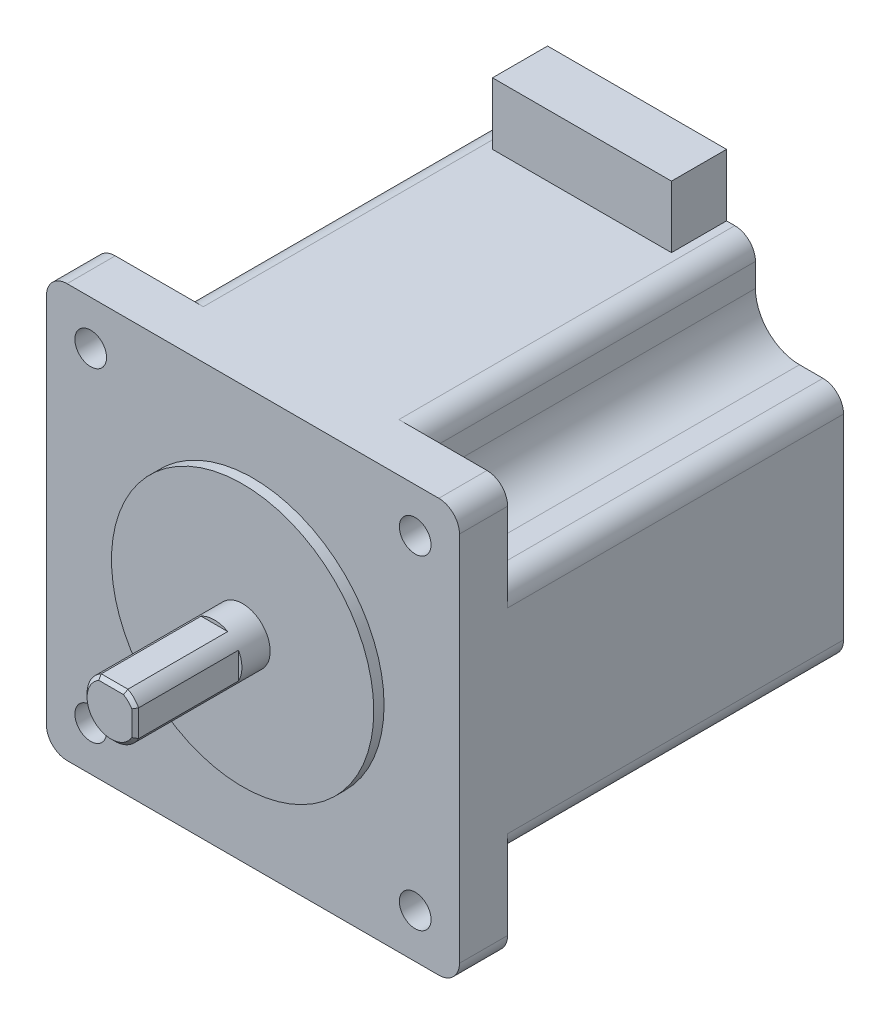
ISO-10303-21;
HEADER;
FILE_DESCRIPTION(('STEP AP214'),'2;1');
FILE_NAME('part.step','',(''),(''),'','','');
FILE_SCHEMA(('AUTOMOTIVE_DESIGN { 1 0 10303 214 1 1 1 1 }'));
ENDSEC;
DATA;
#1=APPLICATION_CONTEXT('core data for automotive mechanical design processes');
#2=APPLICATION_PROTOCOL_DEFINITION('international standard','automotive_design',2000,#1);
#3=PRODUCT_CONTEXT('',#1,'mechanical');
#4=PRODUCT('Part','Part','',(#3));
#5=PRODUCT_RELATED_PRODUCT_CATEGORY('part','',(#4));
#6=PRODUCT_DEFINITION_FORMATION('','',#4);
#7=PRODUCT_DEFINITION_CONTEXT('part definition',#1,'design');
#8=PRODUCT_DEFINITION('design','',#6,#7);
#9=PRODUCT_DEFINITION_SHAPE('','',#8);
#10=(LENGTH_UNIT() NAMED_UNIT(*) SI_UNIT(.MILLI.,.METRE.));
#11=(NAMED_UNIT(*) PLANE_ANGLE_UNIT() SI_UNIT($,.RADIAN.));
#12=(NAMED_UNIT(*) SI_UNIT($,.STERADIAN.) SOLID_ANGLE_UNIT());
#13=UNCERTAINTY_MEASURE_WITH_UNIT(LENGTH_MEASURE(1.E-05),#10,'distance_accuracy_value','');
#14=(GEOMETRIC_REPRESENTATION_CONTEXT(3) GLOBAL_UNCERTAINTY_ASSIGNED_CONTEXT((#13)) GLOBAL_UNIT_ASSIGNED_CONTEXT((#10,
#11,#12)) REPRESENTATION_CONTEXT('',''));
#15=CARTESIAN_POINT('',(0.,0.,0.));
#16=DIRECTION('',(0.,0.,1.));
#17=DIRECTION('',(1.,0.,0.));
#18=AXIS2_PLACEMENT_3D('',#15,#16,#17);
#19=CARTESIAN_POINT('',(13.,39.,-49.3));
#20=DIRECTION('',(1.,0.,0.));
#21=DIRECTION('',(0.,0.,-1.));
#22=AXIS2_PLACEMENT_3D('',#19,#20,#21);
#23=PLANE('',#22);
#24=DIRECTION('',(0.,-1.,0.));
#25=VECTOR('',#24,1.);
#26=CARTESIAN_POINT('',(13.,39.,-57.3));
#27=LINE('',#26,#25);
#28=CARTESIAN_POINT('',(13.,39.,-57.3));
#29=VERTEX_POINT('',#28);
#30=CARTESIAN_POINT('',(13.,30.,-57.3));
#31=VERTEX_POINT('',#30);
#32=EDGE_CURVE('E106',#29,#31,#27,.T.);
#33=ORIENTED_EDGE('',*,*,#32,.F.);
#34=DIRECTION('',(0.,0.,-1.));
#35=VECTOR('',#34,1.);
#36=CARTESIAN_POINT('',(13.,39.,-49.3));
#37=LINE('',#36,#35);
#38=CARTESIAN_POINT('',(13.,39.,-49.3));
#39=VERTEX_POINT('',#38);
#40=EDGE_CURVE('E55',#39,#29,#37,.T.);
#41=ORIENTED_EDGE('',*,*,#40,.F.);
#42=DIRECTION('',(0.,-1.,0.));
#43=VECTOR('',#42,1.);
#44=CARTESIAN_POINT('',(13.,39.,-49.3));
#45=LINE('',#44,#43);
#46=CARTESIAN_POINT('',(13.,30.,-49.3));
#47=VERTEX_POINT('',#46);
#48=EDGE_CURVE('E102',#39,#47,#45,.T.);
#49=ORIENTED_EDGE('',*,*,#48,.T.);
#50=DIRECTION('',(0.,0.,-1.));
#51=VECTOR('',#50,1.);
#52=CARTESIAN_POINT('',(13.,30.,-49.3));
#53=LINE('',#52,#51);
#54=EDGE_CURVE('E12',#47,#31,#53,.T.);
#55=ORIENTED_EDGE('',*,*,#54,.T.);
#56=EDGE_LOOP('',(#33,#41,#49,#55));
#57=FACE_BOUND('',#56,.T.);
#58=ADVANCED_FACE('F45',(#57),#23,.T.);
#59=CARTESIAN_POINT('',(-13.,39.,-49.3));
#60=DIRECTION('',(0.,1.,0.));
#61=DIRECTION('',(0.,0.,1.));
#62=AXIS2_PLACEMENT_3D('',#59,#60,#61);
#63=PLANE('',#62);
#64=DIRECTION('',(1.,0.,0.));
#65=VECTOR('',#64,1.);
#66=CARTESIAN_POINT('',(-13.,39.,-57.3));
#67=LINE('',#66,#65);
#68=CARTESIAN_POINT('',(-13.,39.,-57.3));
#69=VERTEX_POINT('',#68);
#70=EDGE_CURVE('E92',#69,#29,#67,.T.);
#71=ORIENTED_EDGE('',*,*,#70,.F.);
#72=DIRECTION('',(0.,0.,-1.));
#73=VECTOR('',#72,1.);
#74=CARTESIAN_POINT('',(-13.,39.,-49.3));
#75=LINE('',#74,#73);
#76=CARTESIAN_POINT('',(-13.,39.,-49.3));
#77=VERTEX_POINT('',#76);
#78=EDGE_CURVE('E87',#77,#69,#75,.T.);
#79=ORIENTED_EDGE('',*,*,#78,.F.);
#80=DIRECTION('',(1.,0.,0.));
#81=VECTOR('',#80,1.);
#82=CARTESIAN_POINT('',(-13.,39.,-49.3));
#83=LINE('',#82,#81);
#84=EDGE_CURVE('E90',#77,#39,#83,.T.);
#85=ORIENTED_EDGE('',*,*,#84,.T.);
#86=ORIENTED_EDGE('',*,*,#40,.T.);
#87=EDGE_LOOP('',(#71,#79,#85,#86));
#88=FACE_BOUND('',#87,.T.);
#89=ADVANCED_FACE('F89',(#88),#63,.T.);
#90=CARTESIAN_POINT('',(-13.,30.,-49.3));
#91=DIRECTION('',(-1.,0.,0.));
#92=DIRECTION('',(0.,0.,1.));
#93=AXIS2_PLACEMENT_3D('',#90,#91,#92);
#94=PLANE('',#93);
#95=DIRECTION('',(0.,1.,0.));
#96=VECTOR('',#95,1.);
#97=CARTESIAN_POINT('',(-13.,30.,-57.3));
#98=LINE('',#97,#96);
#99=CARTESIAN_POINT('',(-13.,30.,-57.3));
#100=VERTEX_POINT('',#99);
#101=EDGE_CURVE('E111',#100,#69,#98,.T.);
#102=ORIENTED_EDGE('',*,*,#101,.F.);
#103=DIRECTION('',(0.,0.,-1.));
#104=VECTOR('',#103,1.);
#105=CARTESIAN_POINT('',(-13.,30.,-49.3));
#106=LINE('',#105,#104);
#107=CARTESIAN_POINT('',(-13.,30.,-49.3));
#108=VERTEX_POINT('',#107);
#109=EDGE_CURVE('E49',#108,#100,#106,.T.);
#110=ORIENTED_EDGE('',*,*,#109,.F.);
#111=DIRECTION('',(0.,1.,0.));
#112=VECTOR('',#111,1.);
#113=CARTESIAN_POINT('',(-13.,30.,-49.3));
#114=LINE('',#113,#112);
#115=EDGE_CURVE('E100',#108,#77,#114,.T.);
#116=ORIENTED_EDGE('',*,*,#115,.T.);
#117=ORIENTED_EDGE('',*,*,#78,.T.);
#118=EDGE_LOOP('',(#102,#110,#116,#117));
#119=FACE_BOUND('',#118,.T.);
#120=ADVANCED_FACE('F104',(#119),#94,.T.);
#121=CARTESIAN_POINT('',(0.,30.,-49.3));
#122=DIRECTION('',(0.,-1.,0.));
#123=DIRECTION('',(1.,0.,0.));
#124=AXIS2_PLACEMENT_3D('',#121,#122,#123);
#125=PLANE('',#124);
#126=DIRECTION('',(-1.,0.,0.));
#127=VECTOR('',#126,1.);
#128=CARTESIAN_POINT('',(0.,30.,-57.3));
#129=LINE('',#128,#127);
#130=EDGE_CURVE('E82',#31,#100,#129,.T.);
#131=ORIENTED_EDGE('',*,*,#130,.F.);
#132=ORIENTED_EDGE('',*,*,#54,.F.);
#133=DIRECTION('',(-1.,0.,0.));
#134=VECTOR('',#133,1.);
#135=CARTESIAN_POINT('',(13.,30.,-49.3));
#136=LINE('',#135,#134);
#137=EDGE_CURVE('E84',#47,#108,#136,.T.);
#138=ORIENTED_EDGE('',*,*,#137,.T.);
#139=ORIENTED_EDGE('',*,*,#109,.T.);
#140=EDGE_LOOP('',(#131,#132,#138,#139));
#141=FACE_BOUND('',#140,.T.);
#142=ADVANCED_FACE('F47',(#141),#125,.T.);
#143=CARTESIAN_POINT('',(0.,0.,-49.3));
#144=DIRECTION('',(0.,0.,-1.));
#145=DIRECTION('',(-1.,0.,0.));
#146=AXIS2_PLACEMENT_3D('',#143,#144,#145);
#147=PLANE('',#146);
#148=ORIENTED_EDGE('',*,*,#137,.F.);
#149=ORIENTED_EDGE('',*,*,#48,.F.);
#150=ORIENTED_EDGE('',*,*,#84,.F.);
#151=ORIENTED_EDGE('',*,*,#115,.F.);
#152=EDGE_LOOP('',(#148,#149,#150,#151));
#153=FACE_BOUND('',#152,.T.);
#154=ADVANCED_FACE('F99',(#153),#147,.F.);
#155=CARTESIAN_POINT('',(0.,0.,-57.3));
#156=DIRECTION('',(0.,0.,-1.));
#157=DIRECTION('',(-1.,0.,0.));
#158=AXIS2_PLACEMENT_3D('',#155,#156,#157);
#159=PLANE('',#158);
#160=ORIENTED_EDGE('',*,*,#32,.T.);
#161=ORIENTED_EDGE('',*,*,#130,.T.);
#162=ORIENTED_EDGE('',*,*,#101,.T.);
#163=ORIENTED_EDGE('',*,*,#70,.T.);
#164=EDGE_LOOP('',(#160,#161,#162,#163));
#165=FACE_BOUND('',#164,.T.);
#166=ADVANCED_FACE('F118',(#165),#159,.T.);
#167=CLOSED_SHELL('',(#58,#89,#120,#142,#154,#166));
#168=MANIFOLD_SOLID_BREP('B2',#167);
#169=CARTESIAN_POINT('',(27.,-27.,-57.3));
#170=DIRECTION('',(0.,0.,1.));
#171=DIRECTION('',(1.,0.,0.));
#172=AXIS2_PLACEMENT_3D('',#169,#170,#171);
#173=CYLINDRICAL_SURFACE('',#172,3.);
#174=CARTESIAN_POINT('',(27.,-27.,-8.5));
#175=DIRECTION('',(0.,0.,-1.));
#176=DIRECTION('',(-1.,0.,0.));
#177=AXIS2_PLACEMENT_3D('',#174,#175,#176);
#178=CIRCLE('',#177,3.);
#179=CARTESIAN_POINT('',(30.,-27.,-8.5));
#180=VERTEX_POINT('',#179);
#181=CARTESIAN_POINT('',(27.,-30.,-8.5));
#182=VERTEX_POINT('',#181);
#183=EDGE_CURVE('E469',#180,#182,#178,.T.);
#184=ORIENTED_EDGE('',*,*,#183,.F.);
#185=DIRECTION('',(0.,0.,1.));
#186=VECTOR('',#185,1.);
#187=CARTESIAN_POINT('',(30.,-27.,-57.3));
#188=LINE('',#187,#186);
#189=CARTESIAN_POINT('',(30.,-27.,-1.5));
#190=VERTEX_POINT('',#189);
#191=EDGE_CURVE('E644',#180,#190,#188,.T.);
#192=ORIENTED_EDGE('',*,*,#191,.T.);
#193=CARTESIAN_POINT('',(27.,-27.,-1.5));
#194=DIRECTION('',(0.,0.,-1.));
#195=DIRECTION('',(1.,0.,0.));
#196=AXIS2_PLACEMENT_3D('',#193,#194,#195);
#197=CIRCLE('',#196,3.);
#198=CARTESIAN_POINT('',(27.,-30.,-1.5));
#199=VERTEX_POINT('',#198);
#200=EDGE_CURVE('E634',#190,#199,#197,.T.);
#201=ORIENTED_EDGE('',*,*,#200,.T.);
#202=DIRECTION('',(0.,0.,1.));
#203=VECTOR('',#202,1.);
#204=CARTESIAN_POINT('',(27.,-30.,-57.3));
#205=LINE('',#204,#203);
#206=EDGE_CURVE('E680',#182,#199,#205,.T.);
#207=ORIENTED_EDGE('',*,*,#206,.F.);
#208=EDGE_LOOP('',(#184,#192,#201,#207));
#209=FACE_BOUND('',#208,.T.);
#210=ADVANCED_FACE('F171',(#209),#173,.T.);
#211=CARTESIAN_POINT('',(23.57,-23.57,-57.3));
#212=DIRECTION('',(0.,0.,1.));
#213=DIRECTION('',(1.,0.,0.));
#214=AXIS2_PLACEMENT_3D('',#211,#212,#213);
#215=CYLINDRICAL_SURFACE('',#214,2.3);
#216=CARTESIAN_POINT('',(23.57,-23.57,-1.5));
#217=DIRECTION('',(0.,0.,-1.));
#218=DIRECTION('',(-1.,0.,0.));
#219=AXIS2_PLACEMENT_3D('',#216,#217,#218);
#220=CIRCLE('',#219,2.3);
#221=CARTESIAN_POINT('',(21.27,-23.57,-1.5));
#222=VERTEX_POINT('',#221);
#223=EDGE_CURVE('E625',#222,#222,#220,.T.);
#224=ORIENTED_EDGE('',*,*,#223,.F.);
#225=EDGE_LOOP('',(#224));
#226=FACE_BOUND('',#225,.T.);
#227=CARTESIAN_POINT('',(23.57,-23.57,-8.5));
#228=DIRECTION('',(0.,0.,-1.));
#229=DIRECTION('',(-1.,0.,0.));
#230=AXIS2_PLACEMENT_3D('',#227,#228,#229);
#231=CIRCLE('',#230,2.3);
#232=CARTESIAN_POINT('',(21.27,-23.57,-8.5));
#233=VERTEX_POINT('',#232);
#234=EDGE_CURVE('E176',#233,#233,#231,.T.);
#235=ORIENTED_EDGE('',*,*,#234,.T.);
#236=EDGE_LOOP('',(#235));
#237=FACE_BOUND('',#236,.T.);
#238=ADVANCED_FACE('F893',(#226,#237),#215,.F.);
#239=CARTESIAN_POINT('',(-27.,-27.,-57.3));
#240=DIRECTION('',(0.,0.,1.));
#241=DIRECTION('',(1.,0.,0.));
#242=AXIS2_PLACEMENT_3D('',#239,#240,#241);
#243=CYLINDRICAL_SURFACE('',#242,3.);
#244=CARTESIAN_POINT('',(-27.,-27.,-8.5));
#245=DIRECTION('',(0.,0.,-1.));
#246=DIRECTION('',(-1.,0.,0.));
#247=AXIS2_PLACEMENT_3D('',#244,#245,#246);
#248=CIRCLE('',#247,3.);
#249=CARTESIAN_POINT('',(-27.,-30.,-8.5));
#250=VERTEX_POINT('',#249);
#251=CARTESIAN_POINT('',(-30.,-27.,-8.5));
#252=VERTEX_POINT('',#251);
#253=EDGE_CURVE('E197',#250,#252,#248,.T.);
#254=ORIENTED_EDGE('',*,*,#253,.F.);
#255=DIRECTION('',(0.,0.,1.));
#256=VECTOR('',#255,1.);
#257=CARTESIAN_POINT('',(-27.,-30.,-57.3));
#258=LINE('',#257,#256);
#259=CARTESIAN_POINT('',(-27.,-30.,-1.5));
#260=VERTEX_POINT('',#259);
#261=EDGE_CURVE('E678',#250,#260,#258,.T.);
#262=ORIENTED_EDGE('',*,*,#261,.T.);
#263=CARTESIAN_POINT('',(-27.,-27.,-1.5));
#264=DIRECTION('',(0.,0.,-1.));
#265=DIRECTION('',(1.,0.,0.));
#266=AXIS2_PLACEMENT_3D('',#263,#264,#265);
#267=CIRCLE('',#266,3.);
#268=CARTESIAN_POINT('',(-30.,-27.,-1.5));
#269=VERTEX_POINT('',#268);
#270=EDGE_CURVE('E650',#260,#269,#267,.T.);
#271=ORIENTED_EDGE('',*,*,#270,.T.);
#272=DIRECTION('',(0.,0.,1.));
#273=VECTOR('',#272,1.);
#274=CARTESIAN_POINT('',(-30.,-27.,-57.3));
#275=LINE('',#274,#273);
#276=EDGE_CURVE('E676',#252,#269,#275,.T.);
#277=ORIENTED_EDGE('',*,*,#276,.F.);
#278=EDGE_LOOP('',(#254,#262,#271,#277));
#279=FACE_BOUND('',#278,.T.);
#280=ADVANCED_FACE('F784',(#279),#243,.T.);
#281=CARTESIAN_POINT('',(-23.57,-23.57,-57.3));
#282=DIRECTION('',(0.,0.,1.));
#283=DIRECTION('',(1.,0.,0.));
#284=AXIS2_PLACEMENT_3D('',#281,#282,#283);
#285=CYLINDRICAL_SURFACE('',#284,2.3);
#286=CARTESIAN_POINT('',(-23.57,-23.57,-1.5));
#287=DIRECTION('',(0.,0.,-1.));
#288=DIRECTION('',(-1.,0.,0.));
#289=AXIS2_PLACEMENT_3D('',#286,#287,#288);
#290=CIRCLE('',#289,2.3);
#291=CARTESIAN_POINT('',(-25.87,-23.57,-1.5));
#292=VERTEX_POINT('',#291);
#293=EDGE_CURVE('E628',#292,#292,#290,.T.);
#294=ORIENTED_EDGE('',*,*,#293,.F.);
#295=EDGE_LOOP('',(#294));
#296=FACE_BOUND('',#295,.T.);
#297=CARTESIAN_POINT('',(-23.57,-23.57,-8.5));
#298=DIRECTION('',(0.,0.,-1.));
#299=DIRECTION('',(-1.,0.,0.));
#300=AXIS2_PLACEMENT_3D('',#297,#298,#299);
#301=CIRCLE('',#300,2.3);
#302=CARTESIAN_POINT('',(-25.87,-23.57,-8.5));
#303=VERTEX_POINT('',#302);
#304=EDGE_CURVE('E506',#303,#303,#301,.T.);
#305=ORIENTED_EDGE('',*,*,#304,.T.);
#306=EDGE_LOOP('',(#305));
#307=FACE_BOUND('',#306,.T.);
#308=ADVANCED_FACE('F771',(#296,#307),#285,.F.);
#309=CARTESIAN_POINT('',(27.,27.,-57.3));
#310=DIRECTION('',(0.,0.,1.));
#311=DIRECTION('',(1.,0.,0.));
#312=AXIS2_PLACEMENT_3D('',#309,#310,#311);
#313=CYLINDRICAL_SURFACE('',#312,3.);
#314=CARTESIAN_POINT('',(27.,27.,-8.5));
#315=DIRECTION('',(0.,0.,-1.));
#316=DIRECTION('',(-1.,0.,0.));
#317=AXIS2_PLACEMENT_3D('',#314,#315,#316);
#318=CIRCLE('',#317,3.);
#319=CARTESIAN_POINT('',(27.,30.,-8.5));
#320=VERTEX_POINT('',#319);
#321=CARTESIAN_POINT('',(30.,27.,-8.5));
#322=VERTEX_POINT('',#321);
#323=EDGE_CURVE('E568',#320,#322,#318,.T.);
#324=ORIENTED_EDGE('',*,*,#323,.F.);
#325=DIRECTION('',(0.,0.,1.));
#326=VECTOR('',#325,1.);
#327=CARTESIAN_POINT('',(27.,30.,-57.3));
#328=LINE('',#327,#326);
#329=CARTESIAN_POINT('',(27.,30.,-1.5));
#330=VERTEX_POINT('',#329);
#331=EDGE_CURVE('E670',#320,#330,#328,.T.);
#332=ORIENTED_EDGE('',*,*,#331,.T.);
#333=CARTESIAN_POINT('',(27.,27.,-1.5));
#334=DIRECTION('',(0.,0.,-1.));
#335=DIRECTION('',(1.,0.,0.));
#336=AXIS2_PLACEMENT_3D('',#333,#334,#335);
#337=CIRCLE('',#336,3.);
#338=CARTESIAN_POINT('',(30.,27.,-1.5));
#339=VERTEX_POINT('',#338);
#340=EDGE_CURVE('E662',#330,#339,#337,.T.);
#341=ORIENTED_EDGE('',*,*,#340,.T.);
#342=DIRECTION('',(0.,0.,1.));
#343=VECTOR('',#342,1.);
#344=CARTESIAN_POINT('',(30.,27.,-57.3));
#345=LINE('',#344,#343);
#346=EDGE_CURVE('E668',#322,#339,#345,.T.);
#347=ORIENTED_EDGE('',*,*,#346,.F.);
#348=EDGE_LOOP('',(#324,#332,#341,#347));
#349=FACE_BOUND('',#348,.T.);
#350=ADVANCED_FACE('F847',(#349),#313,.T.);
#351=CARTESIAN_POINT('',(23.57,23.57,-57.3));
#352=DIRECTION('',(0.,0.,1.));
#353=DIRECTION('',(1.,0.,0.));
#354=AXIS2_PLACEMENT_3D('',#351,#352,#353);
#355=CYLINDRICAL_SURFACE('',#354,2.3);
#356=CARTESIAN_POINT('',(23.57,23.57,-1.5));
#357=DIRECTION('',(0.,0.,-1.));
#358=DIRECTION('',(-1.,0.,0.));
#359=AXIS2_PLACEMENT_3D('',#356,#357,#358);
#360=CIRCLE('',#359,2.3);
#361=CARTESIAN_POINT('',(21.27,23.57,-1.5));
#362=VERTEX_POINT('',#361);
#363=EDGE_CURVE('E622',#362,#362,#360,.T.);
#364=ORIENTED_EDGE('',*,*,#363,.F.);
#365=EDGE_LOOP('',(#364));
#366=FACE_BOUND('',#365,.T.);
#367=CARTESIAN_POINT('',(23.57,23.57,-8.5));
#368=DIRECTION('',(0.,0.,-1.));
#369=DIRECTION('',(-1.,0.,0.));
#370=AXIS2_PLACEMENT_3D('',#367,#368,#369);
#371=CIRCLE('',#370,2.3);
#372=CARTESIAN_POINT('',(21.27,23.57,-8.5));
#373=VERTEX_POINT('',#372);
#374=EDGE_CURVE('E555',#373,#373,#371,.T.);
#375=ORIENTED_EDGE('',*,*,#374,.T.);
#376=EDGE_LOOP('',(#375));
#377=FACE_BOUND('',#376,.T.);
#378=ADVANCED_FACE('F976',(#366,#377),#355,.F.);
#379=CARTESIAN_POINT('',(-27.,27.,-57.3));
#380=DIRECTION('',(0.,0.,1.));
#381=DIRECTION('',(1.,0.,0.));
#382=AXIS2_PLACEMENT_3D('',#379,#380,#381);
#383=CYLINDRICAL_SURFACE('',#382,3.);
#384=CARTESIAN_POINT('',(-27.,27.,-8.5));
#385=DIRECTION('',(0.,0.,-1.));
#386=DIRECTION('',(-1.,0.,0.));
#387=AXIS2_PLACEMENT_3D('',#384,#385,#386);
#388=CIRCLE('',#387,3.);
#389=CARTESIAN_POINT('',(-30.,27.,-8.5));
#390=VERTEX_POINT('',#389);
#391=CARTESIAN_POINT('',(-27.,30.,-8.5));
#392=VERTEX_POINT('',#391);
#393=EDGE_CURVE('E618',#390,#392,#388,.T.);
#394=ORIENTED_EDGE('',*,*,#393,.F.);
#395=DIRECTION('',(0.,0.,1.));
#396=VECTOR('',#395,1.);
#397=CARTESIAN_POINT('',(-30.,27.,-57.3));
#398=LINE('',#397,#396);
#399=CARTESIAN_POINT('',(-30.,27.,-1.5));
#400=VERTEX_POINT('',#399);
#401=EDGE_CURVE('E674',#390,#400,#398,.T.);
#402=ORIENTED_EDGE('',*,*,#401,.T.);
#403=CARTESIAN_POINT('',(-27.,27.,-1.5));
#404=DIRECTION('',(0.,0.,-1.));
#405=DIRECTION('',(1.,0.,0.));
#406=AXIS2_PLACEMENT_3D('',#403,#404,#405);
#407=CIRCLE('',#406,3.);
#408=CARTESIAN_POINT('',(-27.,30.,-1.5));
#409=VERTEX_POINT('',#408);
#410=EDGE_CURVE('E656',#400,#409,#407,.T.);
#411=ORIENTED_EDGE('',*,*,#410,.T.);
#412=DIRECTION('',(0.,0.,1.));
#413=VECTOR('',#412,1.);
#414=CARTESIAN_POINT('',(-27.,30.,-57.3));
#415=LINE('',#414,#413);
#416=EDGE_CURVE('E672',#392,#409,#415,.T.);
#417=ORIENTED_EDGE('',*,*,#416,.F.);
#418=EDGE_LOOP('',(#394,#402,#411,#417));
#419=FACE_BOUND('',#418,.T.);
#420=ADVANCED_FACE('F856',(#419),#383,.T.);
#421=CARTESIAN_POINT('',(-23.57,23.57,-57.3));
#422=DIRECTION('',(0.,0.,1.));
#423=DIRECTION('',(1.,0.,0.));
#424=AXIS2_PLACEMENT_3D('',#421,#422,#423);
#425=CYLINDRICAL_SURFACE('',#424,2.3);
#426=CARTESIAN_POINT('',(-23.57,23.57,-1.5));
#427=DIRECTION('',(0.,0.,-1.));
#428=DIRECTION('',(-1.,0.,0.));
#429=AXIS2_PLACEMENT_3D('',#426,#427,#428);
#430=CIRCLE('',#429,2.3);
#431=CARTESIAN_POINT('',(-25.87,23.57,-1.5));
#432=VERTEX_POINT('',#431);
#433=EDGE_CURVE('E631',#432,#432,#430,.T.);
#434=ORIENTED_EDGE('',*,*,#433,.F.);
#435=EDGE_LOOP('',(#434));
#436=FACE_BOUND('',#435,.T.);
#437=CARTESIAN_POINT('',(-23.57,23.57,-8.5));
#438=DIRECTION('',(0.,0.,-1.));
#439=DIRECTION('',(-1.,0.,0.));
#440=AXIS2_PLACEMENT_3D('',#437,#438,#439);
#441=CIRCLE('',#440,2.3);
#442=CARTESIAN_POINT('',(-25.87,23.57,-8.5));
#443=VERTEX_POINT('',#442);
#444=EDGE_CURVE('E605',#443,#443,#441,.T.);
#445=ORIENTED_EDGE('',*,*,#444,.T.);
#446=EDGE_LOOP('',(#445));
#447=FACE_BOUND('',#446,.T.);
#448=ADVANCED_FACE('F930',(#436,#447),#425,.F.);
#449=CARTESIAN_POINT('',(0.,0.,0.));
#450=DIRECTION('',(0.,0.,1.));
#451=DIRECTION('',(1.,0.,0.));
#452=AXIS2_PLACEMENT_3D('',#449,#450,#451);
#453=PLANE('',#452);
#454=CARTESIAN_POINT('',(0.,0.,0.));
#455=DIRECTION('',(0.,0.,1.));
#456=DIRECTION('',(1.,0.,0.));
#457=AXIS2_PLACEMENT_3D('',#454,#455,#456);
#458=CIRCLE('',#457,19.05);
#459=CARTESIAN_POINT('',(19.05,0.,0.));
#460=VERTEX_POINT('',#459);
#461=EDGE_CURVE('E706',#460,#460,#458,.T.);
#462=ORIENTED_EDGE('',*,*,#461,.T.);
#463=EDGE_LOOP('',(#462));
#464=FACE_BOUND('',#463,.T.);
#465=CARTESIAN_POINT('',(0.,0.,0.));
#466=DIRECTION('',(0.,0.,1.));
#467=DIRECTION('',(1.,0.,0.));
#468=AXIS2_PLACEMENT_3D('',#465,#466,#467);
#469=CIRCLE('',#468,4.);
#470=CARTESIAN_POINT('',(4.,0.,0.));
#471=VERTEX_POINT('',#470);
#472=EDGE_CURVE('E703',#471,#471,#469,.T.);
#473=ORIENTED_EDGE('',*,*,#472,.F.);
#474=EDGE_LOOP('',(#473));
#475=FACE_BOUND('',#474,.T.);
#476=ADVANCED_FACE('F928',(#464,#475),#453,.T.);
#477=CARTESIAN_POINT('',(0.,0.,-1.5));
#478=DIRECTION('',(0.,0.,1.));
#479=DIRECTION('',(1.,0.,0.));
#480=AXIS2_PLACEMENT_3D('',#477,#478,#479);
#481=CYLINDRICAL_SURFACE('',#480,19.05);
#482=CARTESIAN_POINT('',(0.,0.,-1.5));
#483=DIRECTION('',(0.,0.,1.));
#484=DIRECTION('',(1.,0.,0.));
#485=AXIS2_PLACEMENT_3D('',#482,#483,#484);
#486=CIRCLE('',#485,19.05);
#487=CARTESIAN_POINT('',(19.05,0.,-1.5));
#488=VERTEX_POINT('',#487);
#489=EDGE_CURVE('E682',#488,#488,#486,.F.);
#490=ORIENTED_EDGE('',*,*,#489,.F.);
#491=EDGE_LOOP('',(#490));
#492=FACE_BOUND('',#491,.T.);
#493=ORIENTED_EDGE('',*,*,#461,.F.);
#494=EDGE_LOOP('',(#493));
#495=FACE_BOUND('',#494,.T.);
#496=ADVANCED_FACE('F926',(#492,#495),#481,.T.);
#497=CARTESIAN_POINT('',(0.,0.,19.1));
#498=DIRECTION('',(0.,0.,-1.));
#499=DIRECTION('',(-1.,0.,0.));
#500=AXIS2_PLACEMENT_3D('',#497,#498,#499);
#501=CYLINDRICAL_SURFACE('',#500,4.);
#502=DIRECTION('',(0.,0.,-1.));
#503=VECTOR('',#502,1.);
#504=CARTESIAN_POINT('',(1.93649167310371,3.5,19.1));
#505=LINE('',#504,#503);
#506=CARTESIAN_POINT('',(1.93649167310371,3.5,4.1));
#507=VERTEX_POINT('',#506);
#508=CARTESIAN_POINT('',(1.93649167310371,3.5,18.6));
#509=VERTEX_POINT('',#508);
#510=EDGE_CURVE('E698',#507,#509,#505,.F.);
#511=ORIENTED_EDGE('',*,*,#510,.T.);
#512=CARTESIAN_POINT('',(0.,0.,18.6));
#513=DIRECTION('',(0.,0.,1.));
#514=DIRECTION('',(1.,0.,0.));
#515=AXIS2_PLACEMENT_3D('',#512,#513,#514);
#516=CIRCLE('',#515,4.);
#517=CARTESIAN_POINT('',(3.5,1.93649167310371,18.6));
#518=VERTEX_POINT('',#517);
#519=EDGE_CURVE('E181',#509,#518,#516,.F.);
#520=ORIENTED_EDGE('',*,*,#519,.T.);
#521=DIRECTION('',(0.,0.,-1.));
#522=VECTOR('',#521,1.);
#523=CARTESIAN_POINT('',(3.5,1.93649167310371,19.1));
#524=LINE('',#523,#522);
#525=CARTESIAN_POINT('',(3.5,1.93649167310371,4.1));
#526=VERTEX_POINT('',#525);
#527=EDGE_CURVE('E693',#518,#526,#524,.T.);
#528=ORIENTED_EDGE('',*,*,#527,.T.);
#529=CARTESIAN_POINT('',(0.,0.,4.1));
#530=DIRECTION('',(0.,0.,1.));
#531=DIRECTION('',(1.,0.,0.));
#532=AXIS2_PLACEMENT_3D('',#529,#530,#531);
#533=CIRCLE('',#532,4.);
#534=CARTESIAN_POINT('',(3.5,-1.93649167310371,4.1));
#535=VERTEX_POINT('',#534);
#536=EDGE_CURVE('E712',#535,#526,#533,.T.);
#537=ORIENTED_EDGE('',*,*,#536,.F.);
#538=DIRECTION('',(0.,0.,-1.));
#539=VECTOR('',#538,1.);
#540=CARTESIAN_POINT('',(3.5,-1.93649167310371,19.1));
#541=LINE('',#540,#539);
#542=CARTESIAN_POINT('',(3.5,-1.93649167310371,18.6));
#543=VERTEX_POINT('',#542);
#544=EDGE_CURVE('E689',#535,#543,#541,.F.);
#545=ORIENTED_EDGE('',*,*,#544,.T.);
#546=CARTESIAN_POINT('',(0.,0.,18.6));
#547=DIRECTION('',(0.,0.,1.));
#548=DIRECTION('',(1.,0.,0.));
#549=AXIS2_PLACEMENT_3D('',#546,#547,#548);
#550=CIRCLE('',#549,4.);
#551=CARTESIAN_POINT('',(-1.93649167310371,3.5,18.6));
#552=VERTEX_POINT('',#551);
#553=EDGE_CURVE('E727',#543,#552,#550,.F.);
#554=ORIENTED_EDGE('',*,*,#553,.T.);
#555=DIRECTION('',(0.,0.,-1.));
#556=VECTOR('',#555,1.);
#557=CARTESIAN_POINT('',(-1.93649167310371,3.5,19.1));
#558=LINE('',#557,#556);
#559=CARTESIAN_POINT('',(-1.93649167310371,3.5,4.1));
#560=VERTEX_POINT('',#559);
#561=EDGE_CURVE('E701',#552,#560,#558,.T.);
#562=ORIENTED_EDGE('',*,*,#561,.T.);
#563=CARTESIAN_POINT('',(0.,0.,4.1));
#564=DIRECTION('',(0.,0.,1.));
#565=DIRECTION('',(1.,0.,0.));
#566=AXIS2_PLACEMENT_3D('',#563,#564,#565);
#567=CIRCLE('',#566,4.);
#568=EDGE_CURVE('E709',#507,#560,#567,.T.);
#569=ORIENTED_EDGE('',*,*,#568,.F.);
#570=EDGE_LOOP('',(#511,#520,#528,#537,#545,#554,#562,#569));
#571=FACE_BOUND('',#570,.T.);
#572=ORIENTED_EDGE('',*,*,#472,.T.);
#573=EDGE_LOOP('',(#572));
#574=FACE_BOUND('',#573,.T.);
#575=ADVANCED_FACE('F922',(#571,#574),#501,.T.);
#576=CARTESIAN_POINT('',(0.,0.,19.1));
#577=DIRECTION('',(0.,0.,1.));
#578=DIRECTION('',(1.,0.,0.));
#579=AXIS2_PLACEMENT_3D('',#576,#577,#578);
#580=PLANE('',#579);
#581=CARTESIAN_POINT('',(0.,0.,19.1));
#582=DIRECTION('',(0.,0.,1.));
#583=DIRECTION('',(1.,0.,0.));
#584=AXIS2_PLACEMENT_3D('',#581,#582,#583);
#585=CIRCLE('',#584,3.49999999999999);
#586=CARTESIAN_POINT('',(2.99999999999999,1.8027756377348,19.1));
#587=VERTEX_POINT('',#586);
#588=CARTESIAN_POINT('',(1.8027756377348,2.99999999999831,19.1));
#589=VERTEX_POINT('',#588);
#590=EDGE_CURVE('E722',#587,#589,#585,.T.);
#591=ORIENTED_EDGE('',*,*,#590,.T.);
#592=DIRECTION('',(-1.,0.,0.));
#593=VECTOR('',#592,1.);
#594=CARTESIAN_POINT('',(-1.93649167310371,2.99999999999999,19.1));
#595=LINE('',#594,#593);
#596=CARTESIAN_POINT('',(-1.8027756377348,2.99999999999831,19.1));
#597=VERTEX_POINT('',#596);
#598=EDGE_CURVE('E724',#589,#597,#595,.T.);
#599=ORIENTED_EDGE('',*,*,#598,.T.);
#600=CARTESIAN_POINT('',(0.,0.,19.1));
#601=DIRECTION('',(0.,0.,1.));
#602=DIRECTION('',(1.,0.,0.));
#603=AXIS2_PLACEMENT_3D('',#600,#601,#602);
#604=CIRCLE('',#603,3.49999999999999);
#605=CARTESIAN_POINT('',(2.99999999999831,-1.8027756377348,19.1));
#606=VERTEX_POINT('',#605);
#607=EDGE_CURVE('E718',#597,#606,#604,.T.);
#608=ORIENTED_EDGE('',*,*,#607,.T.);
#609=DIRECTION('',(0.,1.,0.));
#610=VECTOR('',#609,1.);
#611=CARTESIAN_POINT('',(2.99999999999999,1.93649167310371,19.1));
#612=LINE('',#611,#610);
#613=EDGE_CURVE('E720',#606,#587,#612,.T.);
#614=ORIENTED_EDGE('',*,*,#613,.T.);
#615=EDGE_LOOP('',(#591,#599,#608,#614));
#616=FACE_BOUND('',#615,.T.);
#617=ADVANCED_FACE('F915',(#616),#580,.T.);
#618=CARTESIAN_POINT('',(0.,0.,4.1));
#619=DIRECTION('',(0.,0.,1.));
#620=DIRECTION('',(1.,0.,0.));
#621=AXIS2_PLACEMENT_3D('',#618,#619,#620);
#622=PLANE('',#621);
#623=ORIENTED_EDGE('',*,*,#568,.T.);
#624=DIRECTION('',(1.,0.,0.));
#625=VECTOR('',#624,1.);
#626=CARTESIAN_POINT('',(-4.,3.5,4.1));
#627=LINE('',#626,#625);
#628=EDGE_CURVE('E695',#560,#507,#627,.T.);
#629=ORIENTED_EDGE('',*,*,#628,.T.);
#630=EDGE_LOOP('',(#623,#629));
#631=FACE_BOUND('',#630,.T.);
#632=ADVANCED_FACE('F912',(#631),#622,.T.);
#633=CARTESIAN_POINT('',(0.,3.5,4.1));
#634=DIRECTION('',(0.,-1.,0.));
#635=DIRECTION('',(0.,0.,-1.));
#636=AXIS2_PLACEMENT_3D('',#633,#634,#635);
#637=PLANE('',#636);
#638=ORIENTED_EDGE('',*,*,#561,.F.);
#639=DIRECTION('',(1.,0.,0.));
#640=VECTOR('',#639,1.);
#641=CARTESIAN_POINT('',(1.93649167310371,3.5,18.6));
#642=LINE('',#641,#640);
#643=EDGE_CURVE('E715',#552,#509,#642,.T.);
#644=ORIENTED_EDGE('',*,*,#643,.T.);
#645=ORIENTED_EDGE('',*,*,#510,.F.);
#646=ORIENTED_EDGE('',*,*,#628,.F.);
#647=EDGE_LOOP('',(#638,#644,#645,#646));
#648=FACE_BOUND('',#647,.T.);
#649=ADVANCED_FACE('F907',(#648),#637,.F.);
#650=CARTESIAN_POINT('',(0.,0.,4.1));
#651=DIRECTION('',(0.,0.,1.));
#652=DIRECTION('',(1.,0.,0.));
#653=AXIS2_PLACEMENT_3D('',#650,#651,#652);
#654=PLANE('',#653);
#655=ORIENTED_EDGE('',*,*,#536,.T.);
#656=DIRECTION('',(0.,-1.,0.));
#657=VECTOR('',#656,1.);
#658=CARTESIAN_POINT('',(3.5,3.5,4.1));
#659=LINE('',#658,#657);
#660=EDGE_CURVE('E686',#526,#535,#659,.T.);
#661=ORIENTED_EDGE('',*,*,#660,.T.);
#662=EDGE_LOOP('',(#655,#661));
#663=FACE_BOUND('',#662,.T.);
#664=ADVANCED_FACE('F903',(#663),#654,.T.);
#665=CARTESIAN_POINT('',(3.5,0.,4.1));
#666=DIRECTION('',(-1.,0.,0.));
#667=DIRECTION('',(0.,0.,1.));
#668=AXIS2_PLACEMENT_3D('',#665,#666,#667);
#669=PLANE('',#668);
#670=ORIENTED_EDGE('',*,*,#527,.F.);
#671=DIRECTION('',(0.,-1.,0.));
#672=VECTOR('',#671,1.);
#673=CARTESIAN_POINT('',(3.5,-1.93649167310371,18.6));
#674=LINE('',#673,#672);
#675=EDGE_CURVE('E43',#518,#543,#674,.T.);
#676=ORIENTED_EDGE('',*,*,#675,.T.);
#677=ORIENTED_EDGE('',*,*,#544,.F.);
#678=ORIENTED_EDGE('',*,*,#660,.F.);
#679=EDGE_LOOP('',(#670,#676,#677,#678));
#680=FACE_BOUND('',#679,.T.);
#681=ADVANCED_FACE('F906',(#680),#669,.F.);
#682=CARTESIAN_POINT('',(3.5,0.,18.6));
#683=DIRECTION('',(0.707106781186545,0.,0.70710678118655));
#684=DIRECTION('',(0.,1.,0.));
#685=AXIS2_PLACEMENT_3D('',#682,#683,#684);
#686=PLANE('',#685);
#687=CARTESIAN_POINT('',(3.5,1.93649167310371,18.6));
#688=CARTESIAN_POINT('',(3.41656387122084,1.91497488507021,18.6834361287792));
#689=CARTESIAN_POINT('',(3.33317916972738,1.89307349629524,18.7668208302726));
#690=CARTESIAN_POINT('',(3.16651250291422,1.84850148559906,18.9334874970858));
#691=CARTESIAN_POINT('',(3.08323053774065,1.82583086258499,19.0167694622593));
#692=CARTESIAN_POINT('',(2.99999999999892,1.80277563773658,19.1000000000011));
#693=B_SPLINE_CURVE_WITH_KNOTS('',3,(#687,#688,#689,#690,#691,#692),.UNSPECIFIED.,.F.,.F.,(4,2,
4),(0.,0.3598210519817,0.719642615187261),.UNSPECIFIED.);
#694=EDGE_CURVE('E761',#587,#518,#693,.F.);
#695=ORIENTED_EDGE('',*,*,#694,.F.);
#696=ORIENTED_EDGE('',*,*,#613,.F.);
#697=CARTESIAN_POINT('',(3.5,-1.93649167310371,18.6));
#698=CARTESIAN_POINT('',(3.416563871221,-1.91497488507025,18.683436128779));
#699=CARTESIAN_POINT('',(3.33317916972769,-1.89307349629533,18.7668208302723));
#700=CARTESIAN_POINT('',(3.16651250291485,-1.84850148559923,18.9334874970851));
#701=CARTESIAN_POINT('',(3.08323053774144,-1.8258308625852,19.0167694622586));
#702=CARTESIAN_POINT('',(2.99999999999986,-1.80277563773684,19.1000000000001));
#703=B_SPLINE_CURVE_WITH_KNOTS('',3,(#697,#698,#699,#700,#701,#702),.UNSPECIFIED.,.F.,.F.,(4,2,
4),(0.,0.359821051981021,0.719642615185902),.UNSPECIFIED.);
#704=EDGE_CURVE('E690',#543,#606,#703,.T.);
#705=ORIENTED_EDGE('',*,*,#704,.F.);
#706=ORIENTED_EDGE('',*,*,#675,.F.);
#707=EDGE_LOOP('',(#695,#696,#705,#706));
#708=FACE_BOUND('',#707,.T.);
#709=ADVANCED_FACE('F173',(#708),#686,.T.);
#710=CARTESIAN_POINT('',(0.,0.,19.1));
#711=DIRECTION('',(0.,0.,-1.));
#712=DIRECTION('',(-1.,0.,0.));
#713=AXIS2_PLACEMENT_3D('',#710,#711,#712);
#714=CONICAL_SURFACE('',#713,3.49999999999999,0.785398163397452);
#715=ORIENTED_EDGE('',*,*,#704,.T.);
#716=ORIENTED_EDGE('',*,*,#607,.F.);
#717=CARTESIAN_POINT('',(-1.80277563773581,2.99999999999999,19.1));
#718=CARTESIAN_POINT('',(-1.82583086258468,3.0832305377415,19.0167694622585));
#719=CARTESIAN_POINT('',(-1.84850148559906,3.16651250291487,18.9334874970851));
#720=CARTESIAN_POINT('',(-1.8930734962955,3.33317916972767,18.7668208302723));
#721=CARTESIAN_POINT('',(-1.91497488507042,3.41656387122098,18.683436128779));
#722=CARTESIAN_POINT('',(-1.93649167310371,3.5,18.6));
#723=B_SPLINE_CURVE_WITH_KNOTS('',3,(#717,#718,#719,#720,#721,#722),.UNSPECIFIED.,.F.,.F.,(4,2,
4),(0.,0.359821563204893,0.719642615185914),.UNSPECIFIED.);
#724=EDGE_CURVE('E736',#552,#597,#723,.F.);
#725=ORIENTED_EDGE('',*,*,#724,.F.);
#726=ORIENTED_EDGE('',*,*,#553,.F.);
#727=EDGE_LOOP('',(#715,#716,#725,#726));
#728=FACE_BOUND('',#727,.T.);
#729=ADVANCED_FACE('F749',(#728),#714,.T.);
#730=CARTESIAN_POINT('',(0.,0.,19.1));
#731=DIRECTION('',(0.,0.,-1.));
#732=DIRECTION('',(-1.,0.,0.));
#733=AXIS2_PLACEMENT_3D('',#730,#731,#732);
#734=CONICAL_SURFACE('',#733,3.49999999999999,0.785398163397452);
#735=ORIENTED_EDGE('',*,*,#694,.T.);
#736=ORIENTED_EDGE('',*,*,#519,.F.);
#737=CARTESIAN_POINT('',(1.93649167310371,3.5,18.6));
#738=CARTESIAN_POINT('',(1.91497488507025,3.416563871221,18.683436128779));
#739=CARTESIAN_POINT('',(1.89307349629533,3.33317916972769,18.7668208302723));
#740=CARTESIAN_POINT('',(1.84850148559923,3.16651250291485,18.9334874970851));
#741=CARTESIAN_POINT('',(1.8258308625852,3.08323053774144,19.0167694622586));
#742=CARTESIAN_POINT('',(1.80277563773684,2.99999999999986,19.1000000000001));
#743=B_SPLINE_CURVE_WITH_KNOTS('',3,(#737,#738,#739,#740,#741,#742),.UNSPECIFIED.,.F.,.F.,(4,2,
4),(0.,0.359821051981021,0.719642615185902),.UNSPECIFIED.);
#744=EDGE_CURVE('E685',#589,#509,#743,.F.);
#745=ORIENTED_EDGE('',*,*,#744,.F.);
#746=ORIENTED_EDGE('',*,*,#590,.F.);
#747=EDGE_LOOP('',(#735,#736,#745,#746));
#748=FACE_BOUND('',#747,.T.);
#749=ADVANCED_FACE('F741',(#748),#734,.T.);
#750=CARTESIAN_POINT('',(0.,3.5,18.6));
#751=DIRECTION('',(0.,0.707106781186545,0.70710678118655));
#752=DIRECTION('',(-1.,0.,0.));
#753=AXIS2_PLACEMENT_3D('',#750,#751,#752);
#754=PLANE('',#753);
#755=ORIENTED_EDGE('',*,*,#724,.T.);
#756=ORIENTED_EDGE('',*,*,#598,.F.);
#757=ORIENTED_EDGE('',*,*,#744,.T.);
#758=ORIENTED_EDGE('',*,*,#643,.F.);
#759=EDGE_LOOP('',(#755,#756,#757,#758));
#760=FACE_BOUND('',#759,.T.);
#761=ADVANCED_FACE('F744',(#760),#754,.T.);
#762=CARTESIAN_POINT('',(27.,-27.,-57.3));
#763=DIRECTION('',(0.,0.,1.));
#764=DIRECTION('',(1.,0.,0.));
#765=AXIS2_PLACEMENT_3D('',#762,#763,#764);
#766=PLANE('',#765);
#767=DIRECTION('',(0.,1.,0.));
#768=VECTOR('',#767,1.);
#769=CARTESIAN_POINT('',(17.2,-27.,-57.3));
#770=LINE('',#769,#768);
#771=CARTESIAN_POINT('',(17.2,-27.,-57.3));
#772=VERTEX_POINT('',#771);
#773=CARTESIAN_POINT('',(17.2,-23.6,-57.3));
#774=VERTEX_POINT('',#773);
#775=EDGE_CURVE('E439',#772,#774,#770,.T.);
#776=ORIENTED_EDGE('',*,*,#775,.F.);
#777=CARTESIAN_POINT('',(14.2,-27.,-57.3));
#778=DIRECTION('',(0.,0.,1.));
#779=DIRECTION('',(1.,0.,0.));
#780=AXIS2_PLACEMENT_3D('',#777,#778,#779);
#781=CIRCLE('',#780,2.99999999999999);
#782=CARTESIAN_POINT('',(14.2,-30.,-57.3));
#783=VERTEX_POINT('',#782);
#784=EDGE_CURVE('E442',#783,#772,#781,.T.);
#785=ORIENTED_EDGE('',*,*,#784,.F.);
#786=DIRECTION('',(-1.,0.,0.));
#787=VECTOR('',#786,1.);
#788=CARTESIAN_POINT('',(-27.,-30.,-57.3));
#789=LINE('',#788,#787);
#790=CARTESIAN_POINT('',(-14.2,-30.,-57.3));
#791=VERTEX_POINT('',#790);
#792=EDGE_CURVE('E635',#783,#791,#789,.T.);
#793=ORIENTED_EDGE('',*,*,#792,.T.);
#794=CARTESIAN_POINT('',(-14.2,-27.,-57.3));
#795=DIRECTION('',(0.,0.,1.));
#796=DIRECTION('',(-1.,0.,0.));
#797=AXIS2_PLACEMENT_3D('',#794,#795,#796);
#798=CIRCLE('',#797,3.);
#799=CARTESIAN_POINT('',(-17.2,-27.,-57.3));
#800=VERTEX_POINT('',#799);
#801=EDGE_CURVE('E473',#800,#791,#798,.T.);
#802=ORIENTED_EDGE('',*,*,#801,.F.);
#803=DIRECTION('',(0.,-1.,0.));
#804=VECTOR('',#803,1.);
#805=CARTESIAN_POINT('',(-17.2,-27.,-57.3));
#806=LINE('',#805,#804);
#807=CARTESIAN_POINT('',(-17.2,-23.6,-57.3));
#808=VERTEX_POINT('',#807);
#809=EDGE_CURVE('E478',#808,#800,#806,.T.);
#810=ORIENTED_EDGE('',*,*,#809,.F.);
#811=CARTESIAN_POINT('',(-23.6,-23.6,-57.3));
#812=DIRECTION('',(0.,0.,-1.));
#813=DIRECTION('',(1.,0.,0.));
#814=AXIS2_PLACEMENT_3D('',#811,#812,#813);
#815=CIRCLE('',#814,6.4);
#816=CARTESIAN_POINT('',(-23.6,-17.2,-57.3));
#817=VERTEX_POINT('',#816);
#818=EDGE_CURVE('E499',#817,#808,#815,.T.);
#819=ORIENTED_EDGE('',*,*,#818,.F.);
#820=DIRECTION('',(1.,0.,0.));
#821=VECTOR('',#820,1.);
#822=CARTESIAN_POINT('',(-23.6,-17.2,-57.3));
#823=LINE('',#822,#821);
#824=CARTESIAN_POINT('',(-27.,-17.2,-57.3));
#825=VERTEX_POINT('',#824);
#826=EDGE_CURVE('E496',#825,#817,#823,.T.);
#827=ORIENTED_EDGE('',*,*,#826,.F.);
#828=CARTESIAN_POINT('',(-27.,-14.2,-57.3));
#829=DIRECTION('',(0.,0.,1.));
#830=DIRECTION('',(-1.,0.,0.));
#831=AXIS2_PLACEMENT_3D('',#828,#829,#830);
#832=CIRCLE('',#831,3.);
#833=CARTESIAN_POINT('',(-30.,-14.2,-57.3));
#834=VERTEX_POINT('',#833);
#835=EDGE_CURVE('E493',#834,#825,#832,.T.);
#836=ORIENTED_EDGE('',*,*,#835,.F.);
#837=DIRECTION('',(0.,1.,0.));
#838=VECTOR('',#837,1.);
#839=CARTESIAN_POINT('',(-30.,27.,-57.3));
#840=LINE('',#839,#838);
#841=CARTESIAN_POINT('',(-30.,14.2,-57.3));
#842=VERTEX_POINT('',#841);
#843=EDGE_CURVE('E637',#834,#842,#840,.T.);
#844=ORIENTED_EDGE('',*,*,#843,.T.);
#845=CARTESIAN_POINT('',(-27.,14.2,-57.3));
#846=DIRECTION('',(0.,0.,1.));
#847=DIRECTION('',(1.,0.,0.));
#848=AXIS2_PLACEMENT_3D('',#845,#846,#847);
#849=CIRCLE('',#848,3.);
#850=CARTESIAN_POINT('',(-27.,17.2,-57.3));
#851=VERTEX_POINT('',#850);
#852=EDGE_CURVE('E595',#851,#842,#849,.T.);
#853=ORIENTED_EDGE('',*,*,#852,.F.);
#854=DIRECTION('',(-1.,0.,0.));
#855=VECTOR('',#854,1.);
#856=CARTESIAN_POINT('',(-23.6,17.2,-57.3));
#857=LINE('',#856,#855);
#858=CARTESIAN_POINT('',(-23.6,17.2,-57.3));
#859=VERTEX_POINT('',#858);
#860=EDGE_CURVE('E592',#859,#851,#857,.T.);
#861=ORIENTED_EDGE('',*,*,#860,.F.);
#862=CARTESIAN_POINT('',(-23.6,23.6,-57.3));
#863=DIRECTION('',(0.,0.,-1.));
#864=DIRECTION('',(-1.,0.,0.));
#865=AXIS2_PLACEMENT_3D('',#862,#863,#864);
#866=CIRCLE('',#865,6.4);
#867=CARTESIAN_POINT('',(-17.2,23.6,-57.3));
#868=VERTEX_POINT('',#867);
#869=EDGE_CURVE('E572',#868,#859,#866,.T.);
#870=ORIENTED_EDGE('',*,*,#869,.F.);
#871=DIRECTION('',(0.,-1.,0.));
#872=VECTOR('',#871,1.);
#873=CARTESIAN_POINT('',(-17.2,27.,-57.3));
#874=LINE('',#873,#872);
#875=CARTESIAN_POINT('',(-17.2,27.,-57.3));
#876=VERTEX_POINT('',#875);
#877=EDGE_CURVE('E577',#876,#868,#874,.T.);
#878=ORIENTED_EDGE('',*,*,#877,.F.);
#879=CARTESIAN_POINT('',(-14.2,27.,-57.3));
#880=DIRECTION('',(0.,0.,1.));
#881=DIRECTION('',(1.,0.,0.));
#882=AXIS2_PLACEMENT_3D('',#879,#880,#881);
#883=CIRCLE('',#882,3.);
#884=CARTESIAN_POINT('',(-14.2,30.,-57.3));
#885=VERTEX_POINT('',#884);
#886=EDGE_CURVE('E598',#885,#876,#883,.T.);
#887=ORIENTED_EDGE('',*,*,#886,.F.);
#888=DIRECTION('',(1.,0.,0.));
#889=VECTOR('',#888,1.);
#890=CARTESIAN_POINT('',(0.,30.,-57.3));
#891=LINE('',#890,#889);
#892=CARTESIAN_POINT('',(14.2,30.,-57.3));
#893=VERTEX_POINT('',#892);
#894=EDGE_CURVE('E640',#885,#893,#891,.T.);
#895=ORIENTED_EDGE('',*,*,#894,.T.);
#896=CARTESIAN_POINT('',(14.2,27.,-57.3));
#897=DIRECTION('',(0.,0.,1.));
#898=DIRECTION('',(-1.,0.,0.));
#899=AXIS2_PLACEMENT_3D('',#896,#897,#898);
#900=CIRCLE('',#899,2.99999999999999);
#901=CARTESIAN_POINT('',(17.2,27.,-57.3));
#902=VERTEX_POINT('',#901);
#903=EDGE_CURVE('E522',#902,#893,#900,.T.);
#904=ORIENTED_EDGE('',*,*,#903,.F.);
#905=DIRECTION('',(0.,1.,0.));
#906=VECTOR('',#905,1.);
#907=CARTESIAN_POINT('',(17.2,27.,-57.3));
#908=LINE('',#907,#906);
#909=CARTESIAN_POINT('',(17.2,23.6,-57.3));
#910=VERTEX_POINT('',#909);
#911=EDGE_CURVE('E527',#910,#902,#908,.T.);
#912=ORIENTED_EDGE('',*,*,#911,.F.);
#913=CARTESIAN_POINT('',(23.6,23.6,-57.3));
#914=DIRECTION('',(0.,0.,-1.));
#915=DIRECTION('',(1.,0.,0.));
#916=AXIS2_PLACEMENT_3D('',#913,#914,#915);
#917=CIRCLE('',#916,6.4);
#918=CARTESIAN_POINT('',(23.6,17.2,-57.3));
#919=VERTEX_POINT('',#918);
#920=EDGE_CURVE('E548',#919,#910,#917,.T.);
#921=ORIENTED_EDGE('',*,*,#920,.F.);
#922=DIRECTION('',(-1.,0.,0.));
#923=VECTOR('',#922,1.);
#924=CARTESIAN_POINT('',(23.6,17.2,-57.3));
#925=LINE('',#924,#923);
#926=CARTESIAN_POINT('',(27.,17.2,-57.3));
#927=VERTEX_POINT('',#926);
#928=EDGE_CURVE('E545',#927,#919,#925,.T.);
#929=ORIENTED_EDGE('',*,*,#928,.F.);
#930=CARTESIAN_POINT('',(27.,14.2,-57.3));
#931=DIRECTION('',(0.,0.,1.));
#932=DIRECTION('',(-1.,0.,0.));
#933=AXIS2_PLACEMENT_3D('',#930,#931,#932);
#934=CIRCLE('',#933,3.);
#935=CARTESIAN_POINT('',(30.,14.2,-57.3));
#936=VERTEX_POINT('',#935);
#937=EDGE_CURVE('E542',#936,#927,#934,.T.);
#938=ORIENTED_EDGE('',*,*,#937,.F.);
#939=DIRECTION('',(0.,-1.,0.));
#940=VECTOR('',#939,1.);
#941=CARTESIAN_POINT('',(30.,-27.,-57.3));
#942=LINE('',#941,#940);
#943=CARTESIAN_POINT('',(30.,-14.2,-57.3));
#944=VERTEX_POINT('',#943);
#945=EDGE_CURVE('E642',#936,#944,#942,.T.);
#946=ORIENTED_EDGE('',*,*,#945,.T.);
#947=CARTESIAN_POINT('',(27.,-14.2,-57.3));
#948=DIRECTION('',(0.,0.,1.));
#949=DIRECTION('',(1.,0.,0.));
#950=AXIS2_PLACEMENT_3D('',#947,#948,#949);
#951=CIRCLE('',#950,3.);
#952=CARTESIAN_POINT('',(27.,-17.2,-57.3));
#953=VERTEX_POINT('',#952);
#954=EDGE_CURVE('E452',#953,#944,#951,.T.);
#955=ORIENTED_EDGE('',*,*,#954,.F.);
#956=DIRECTION('',(1.,0.,0.));
#957=VECTOR('',#956,1.);
#958=CARTESIAN_POINT('',(23.6,-17.2,-57.3));
#959=LINE('',#958,#957);
#960=CARTESIAN_POINT('',(23.6,-17.2,-57.3));
#961=VERTEX_POINT('',#960);
#962=EDGE_CURVE('E450',#961,#953,#959,.T.);
#963=ORIENTED_EDGE('',*,*,#962,.F.);
#964=CARTESIAN_POINT('',(23.6,-23.6,-57.3));
#965=DIRECTION('',(0.,0.,-1.));
#966=DIRECTION('',(-1.,0.,0.));
#967=AXIS2_PLACEMENT_3D('',#964,#965,#966);
#968=CIRCLE('',#967,6.4);
#969=EDGE_CURVE('E426',#774,#961,#968,.T.);
#970=ORIENTED_EDGE('',*,*,#969,.F.);
#971=EDGE_LOOP('',(#776,#785,#793,#802,#810,#819,#827,#836,#844,#853,#861,#870,#878,#887,#895,
#904,#912,#921,#929,#938,#946,#955,#963,#970));
#972=FACE_BOUND('',#971,.T.);
#973=ADVANCED_FACE('F747',(#972),#766,.F.);
#974=CARTESIAN_POINT('',(27.,-27.,-1.5));
#975=DIRECTION('',(0.,0.,1.));
#976=DIRECTION('',(1.,0.,0.));
#977=AXIS2_PLACEMENT_3D('',#974,#975,#976);
#978=PLANE('',#977);
#979=ORIENTED_EDGE('',*,*,#489,.T.);
#980=EDGE_LOOP('',(#979));
#981=FACE_BOUND('',#980,.T.);
#982=ORIENTED_EDGE('',*,*,#223,.T.);
#983=EDGE_LOOP('',(#982));
#984=FACE_BOUND('',#983,.T.);
#985=ORIENTED_EDGE('',*,*,#433,.T.);
#986=EDGE_LOOP('',(#985));
#987=FACE_BOUND('',#986,.T.);
#988=ORIENTED_EDGE('',*,*,#200,.F.);
#989=DIRECTION('',(0.,-1.,0.));
#990=VECTOR('',#989,1.);
#991=CARTESIAN_POINT('',(30.,-27.,-1.5));
#992=LINE('',#991,#990);
#993=EDGE_CURVE('E638',#339,#190,#992,.T.);
#994=ORIENTED_EDGE('',*,*,#993,.F.);
#995=ORIENTED_EDGE('',*,*,#340,.F.);
#996=DIRECTION('',(1.,0.,0.));
#997=VECTOR('',#996,1.);
#998=CARTESIAN_POINT('',(27.,30.,-1.5));
#999=LINE('',#998,#997);
#1000=EDGE_CURVE('E659',#409,#330,#999,.T.);
#1001=ORIENTED_EDGE('',*,*,#1000,.F.);
#1002=ORIENTED_EDGE('',*,*,#410,.F.);
#1003=DIRECTION('',(0.,1.,0.));
#1004=VECTOR('',#1003,1.);
#1005=CARTESIAN_POINT('',(-30.,27.,-1.5));
#1006=LINE('',#1005,#1004);
#1007=EDGE_CURVE('E653',#269,#400,#1006,.T.);
#1008=ORIENTED_EDGE('',*,*,#1007,.F.);
#1009=ORIENTED_EDGE('',*,*,#270,.F.);
#1010=DIRECTION('',(-1.,0.,0.));
#1011=VECTOR('',#1010,1.);
#1012=CARTESIAN_POINT('',(-27.,-30.,-1.5));
#1013=LINE('',#1012,#1011);
#1014=EDGE_CURVE('E647',#199,#260,#1013,.T.);
#1015=ORIENTED_EDGE('',*,*,#1014,.F.);
#1016=EDGE_LOOP('',(#988,#994,#995,#1001,#1002,#1008,#1009,#1015));
#1017=FACE_BOUND('',#1016,.T.);
#1018=ORIENTED_EDGE('',*,*,#293,.T.);
#1019=EDGE_LOOP('',(#1018));
#1020=FACE_BOUND('',#1019,.T.);
#1021=ORIENTED_EDGE('',*,*,#363,.T.);
#1022=EDGE_LOOP('',(#1021));
#1023=FACE_BOUND('',#1022,.T.);
#1024=ADVANCED_FACE('F793',(#981,#984,#987,#1017,#1020,#1023),#978,.T.);
#1025=CARTESIAN_POINT('',(-27.,-30.,-57.3));
#1026=DIRECTION('',(0.,1.,0.));
#1027=DIRECTION('',(-1.,0.,0.));
#1028=AXIS2_PLACEMENT_3D('',#1025,#1026,#1027);
#1029=PLANE('',#1028);
#1030=DIRECTION('',(0.,0.,-1.));
#1031=VECTOR('',#1030,1.);
#1032=CARTESIAN_POINT('',(-14.2,-30.,-8.5));
#1033=LINE('',#1032,#1031);
#1034=CARTESIAN_POINT('',(-14.2,-30.,-8.5));
#1035=VERTEX_POINT('',#1034);
#1036=EDGE_CURVE('E490',#1035,#791,#1033,.T.);
#1037=ORIENTED_EDGE('',*,*,#1036,.T.);
#1038=ORIENTED_EDGE('',*,*,#792,.F.);
#1039=DIRECTION('',(0.,0.,-1.));
#1040=VECTOR('',#1039,1.);
#1041=CARTESIAN_POINT('',(14.2,-30.,-8.5));
#1042=LINE('',#1041,#1040);
#1043=CARTESIAN_POINT('',(14.2,-30.,-8.5));
#1044=VERTEX_POINT('',#1043);
#1045=EDGE_CURVE('E461',#1044,#783,#1042,.T.);
#1046=ORIENTED_EDGE('',*,*,#1045,.F.);
#1047=DIRECTION('',(-1.,0.,0.));
#1048=VECTOR('',#1047,1.);
#1049=CARTESIAN_POINT('',(-27.,-30.,-8.5));
#1050=LINE('',#1049,#1048);
#1051=EDGE_CURVE('E471',#182,#1044,#1050,.T.);
#1052=ORIENTED_EDGE('',*,*,#1051,.F.);
#1053=ORIENTED_EDGE('',*,*,#206,.T.);
#1054=ORIENTED_EDGE('',*,*,#1014,.T.);
#1055=ORIENTED_EDGE('',*,*,#261,.F.);
#1056=DIRECTION('',(-1.,0.,0.));
#1057=VECTOR('',#1056,1.);
#1058=CARTESIAN_POINT('',(-27.,-30.,-8.5));
#1059=LINE('',#1058,#1057);
#1060=EDGE_CURVE('E520',#1035,#250,#1059,.T.);
#1061=ORIENTED_EDGE('',*,*,#1060,.F.);
#1062=EDGE_LOOP('',(#1037,#1038,#1046,#1052,#1053,#1054,#1055,#1061));
#1063=FACE_BOUND('',#1062,.T.);
#1064=ADVANCED_FACE('F785',(#1063),#1029,.F.);
#1065=CARTESIAN_POINT('',(-30.,27.,-57.3));
#1066=DIRECTION('',(1.,0.,0.));
#1067=DIRECTION('',(0.,1.,0.));
#1068=AXIS2_PLACEMENT_3D('',#1065,#1066,#1067);
#1069=PLANE('',#1068);
#1070=DIRECTION('',(0.,0.,-1.));
#1071=VECTOR('',#1070,1.);
#1072=CARTESIAN_POINT('',(-30.,14.2,-8.5));
#1073=LINE('',#1072,#1071);
#1074=CARTESIAN_POINT('',(-30.,14.2,-8.5));
#1075=VERTEX_POINT('',#1074);
#1076=EDGE_CURVE('E610',#1075,#842,#1073,.T.);
#1077=ORIENTED_EDGE('',*,*,#1076,.T.);
#1078=ORIENTED_EDGE('',*,*,#843,.F.);
#1079=DIRECTION('',(0.,0.,-1.));
#1080=VECTOR('',#1079,1.);
#1081=CARTESIAN_POINT('',(-30.,-14.2,-8.5));
#1082=LINE('',#1081,#1080);
#1083=CARTESIAN_POINT('',(-30.,-14.2,-8.5));
#1084=VERTEX_POINT('',#1083);
#1085=EDGE_CURVE('E513',#1084,#834,#1082,.T.);
#1086=ORIENTED_EDGE('',*,*,#1085,.F.);
#1087=DIRECTION('',(0.,1.,0.));
#1088=VECTOR('',#1087,1.);
#1089=CARTESIAN_POINT('',(-30.,27.,-8.5));
#1090=LINE('',#1089,#1088);
#1091=EDGE_CURVE('E517',#252,#1084,#1090,.T.);
#1092=ORIENTED_EDGE('',*,*,#1091,.F.);
#1093=ORIENTED_EDGE('',*,*,#276,.T.);
#1094=ORIENTED_EDGE('',*,*,#1007,.T.);
#1095=ORIENTED_EDGE('',*,*,#401,.F.);
#1096=DIRECTION('',(0.,1.,0.));
#1097=VECTOR('',#1096,1.);
#1098=CARTESIAN_POINT('',(-30.,27.,-8.5));
#1099=LINE('',#1098,#1097);
#1100=EDGE_CURVE('E620',#1075,#390,#1099,.T.);
#1101=ORIENTED_EDGE('',*,*,#1100,.F.);
#1102=EDGE_LOOP('',(#1077,#1078,#1086,#1092,#1093,#1094,#1095,#1101));
#1103=FACE_BOUND('',#1102,.T.);
#1104=ADVANCED_FACE('F799',(#1103),#1069,.F.);
#1105=CARTESIAN_POINT('',(27.,30.,-57.3));
#1106=DIRECTION('',(0.,-1.,0.));
#1107=DIRECTION('',(1.,0.,0.));
#1108=AXIS2_PLACEMENT_3D('',#1105,#1106,#1107);
#1109=PLANE('',#1108);
#1110=DIRECTION('',(0.,0.,-1.));
#1111=VECTOR('',#1110,1.);
#1112=CARTESIAN_POINT('',(14.2,30.,-8.5));
#1113=LINE('',#1112,#1111);
#1114=CARTESIAN_POINT('',(14.2,30.,-8.5));
#1115=VERTEX_POINT('',#1114);
#1116=EDGE_CURVE('E539',#1115,#893,#1113,.T.);
#1117=ORIENTED_EDGE('',*,*,#1116,.T.);
#1118=ORIENTED_EDGE('',*,*,#894,.F.);
#1119=DIRECTION('',(0.,0.,-1.));
#1120=VECTOR('',#1119,1.);
#1121=CARTESIAN_POINT('',(-14.2,30.,-8.5));
#1122=LINE('',#1121,#1120);
#1123=CARTESIAN_POINT('',(-14.2,30.,-8.5));
#1124=VERTEX_POINT('',#1123);
#1125=EDGE_CURVE('E608',#1124,#885,#1122,.T.);
#1126=ORIENTED_EDGE('',*,*,#1125,.F.);
#1127=DIRECTION('',(1.,0.,0.));
#1128=VECTOR('',#1127,1.);
#1129=CARTESIAN_POINT('',(27.,30.,-8.5));
#1130=LINE('',#1129,#1128);
#1131=EDGE_CURVE('E616',#392,#1124,#1130,.T.);
#1132=ORIENTED_EDGE('',*,*,#1131,.F.);
#1133=ORIENTED_EDGE('',*,*,#416,.T.);
#1134=ORIENTED_EDGE('',*,*,#1000,.T.);
#1135=ORIENTED_EDGE('',*,*,#331,.F.);
#1136=DIRECTION('',(1.,0.,0.));
#1137=VECTOR('',#1136,1.);
#1138=CARTESIAN_POINT('',(27.,30.,-8.5));
#1139=LINE('',#1138,#1137);
#1140=EDGE_CURVE('E570',#1115,#320,#1139,.T.);
#1141=ORIENTED_EDGE('',*,*,#1140,.F.);
#1142=EDGE_LOOP('',(#1117,#1118,#1126,#1132,#1133,#1134,#1135,#1141));
#1143=FACE_BOUND('',#1142,.T.);
#1144=ADVANCED_FACE('F851',(#1143),#1109,.F.);
#1145=CARTESIAN_POINT('',(30.,-27.,-57.3));
#1146=DIRECTION('',(-1.,0.,0.));
#1147=DIRECTION('',(0.,0.,1.));
#1148=AXIS2_PLACEMENT_3D('',#1145,#1146,#1147);
#1149=PLANE('',#1148);
#1150=DIRECTION('',(0.,0.,-1.));
#1151=VECTOR('',#1150,1.);
#1152=CARTESIAN_POINT('',(30.,-14.2,-8.5));
#1153=LINE('',#1152,#1151);
#1154=CARTESIAN_POINT('',(30.,-14.2,-8.5));
#1155=VERTEX_POINT('',#1154);
#1156=EDGE_CURVE('E463',#1155,#944,#1153,.T.);
#1157=ORIENTED_EDGE('',*,*,#1156,.T.);
#1158=ORIENTED_EDGE('',*,*,#945,.F.);
#1159=DIRECTION('',(0.,0.,-1.));
#1160=VECTOR('',#1159,1.);
#1161=CARTESIAN_POINT('',(30.,14.2,-8.5));
#1162=LINE('',#1161,#1160);
#1163=CARTESIAN_POINT('',(30.,14.2,-8.5));
#1164=VERTEX_POINT('',#1163);
#1165=EDGE_CURVE('E562',#1164,#936,#1162,.T.);
#1166=ORIENTED_EDGE('',*,*,#1165,.F.);
#1167=DIRECTION('',(0.,-1.,0.));
#1168=VECTOR('',#1167,1.);
#1169=CARTESIAN_POINT('',(30.,-27.,-8.5));
#1170=LINE('',#1169,#1168);
#1171=EDGE_CURVE('E566',#322,#1164,#1170,.T.);
#1172=ORIENTED_EDGE('',*,*,#1171,.F.);
#1173=ORIENTED_EDGE('',*,*,#346,.T.);
#1174=ORIENTED_EDGE('',*,*,#993,.T.);
#1175=ORIENTED_EDGE('',*,*,#191,.F.);
#1176=DIRECTION('',(0.,-1.,0.));
#1177=VECTOR('',#1176,1.);
#1178=CARTESIAN_POINT('',(30.,-27.,-8.5));
#1179=LINE('',#1178,#1177);
#1180=EDGE_CURVE('E467',#1155,#180,#1179,.T.);
#1181=ORIENTED_EDGE('',*,*,#1180,.F.);
#1182=EDGE_LOOP('',(#1157,#1158,#1166,#1172,#1173,#1174,#1175,#1181));
#1183=FACE_BOUND('',#1182,.T.);
#1184=ADVANCED_FACE('F836',(#1183),#1149,.F.);
#1185=CARTESIAN_POINT('',(-23.6,23.6,-8.5));
#1186=DIRECTION('',(0.,0.,-1.));
#1187=DIRECTION('',(-1.,0.,0.));
#1188=AXIS2_PLACEMENT_3D('',#1185,#1186,#1187);
#1189=PLANE('',#1188);
#1190=ORIENTED_EDGE('',*,*,#444,.F.);
#1191=EDGE_LOOP('',(#1190));
#1192=FACE_BOUND('',#1191,.T.);
#1193=ORIENTED_EDGE('',*,*,#1100,.T.);
#1194=ORIENTED_EDGE('',*,*,#393,.T.);
#1195=ORIENTED_EDGE('',*,*,#1131,.T.);
#1196=CARTESIAN_POINT('',(-14.2,27.,-8.5));
#1197=DIRECTION('',(0.,0.,1.));
#1198=DIRECTION('',(1.,0.,0.));
#1199=AXIS2_PLACEMENT_3D('',#1196,#1197,#1198);
#1200=CIRCLE('',#1199,3.);
#1201=CARTESIAN_POINT('',(-17.2,27.,-8.5));
#1202=VERTEX_POINT('',#1201);
#1203=EDGE_CURVE('E583',#1124,#1202,#1200,.T.);
#1204=ORIENTED_EDGE('',*,*,#1203,.T.);
#1205=DIRECTION('',(0.,-1.,0.));
#1206=VECTOR('',#1205,1.);
#1207=CARTESIAN_POINT('',(-17.2,27.,-8.5));
#1208=LINE('',#1207,#1206);
#1209=CARTESIAN_POINT('',(-17.2,23.6,-8.5));
#1210=VERTEX_POINT('',#1209);
#1211=EDGE_CURVE('E586',#1202,#1210,#1208,.T.);
#1212=ORIENTED_EDGE('',*,*,#1211,.T.);
#1213=CARTESIAN_POINT('',(-23.6,23.6,-8.5));
#1214=DIRECTION('',(0.,0.,-1.));
#1215=DIRECTION('',(-1.,0.,0.));
#1216=AXIS2_PLACEMENT_3D('',#1213,#1214,#1215);
#1217=CIRCLE('',#1216,6.4);
#1218=CARTESIAN_POINT('',(-23.6,17.2,-8.5));
#1219=VERTEX_POINT('',#1218);
#1220=EDGE_CURVE('E573',#1210,#1219,#1217,.T.);
#1221=ORIENTED_EDGE('',*,*,#1220,.T.);
#1222=DIRECTION('',(-1.,0.,0.));
#1223=VECTOR('',#1222,1.);
#1224=CARTESIAN_POINT('',(-23.6,17.2,-8.5));
#1225=LINE('',#1224,#1223);
#1226=CARTESIAN_POINT('',(-27.,17.2,-8.5));
#1227=VERTEX_POINT('',#1226);
#1228=EDGE_CURVE('E576',#1219,#1227,#1225,.T.);
#1229=ORIENTED_EDGE('',*,*,#1228,.T.);
#1230=CARTESIAN_POINT('',(-27.,14.2,-8.5));
#1231=DIRECTION('',(0.,0.,1.));
#1232=DIRECTION('',(1.,0.,0.));
#1233=AXIS2_PLACEMENT_3D('',#1230,#1231,#1232);
#1234=CIRCLE('',#1233,3.);
#1235=EDGE_CURVE('E580',#1227,#1075,#1234,.T.);
#1236=ORIENTED_EDGE('',*,*,#1235,.T.);
#1237=EDGE_LOOP('',(#1193,#1194,#1195,#1204,#1212,#1221,#1229,#1236));
#1238=FACE_BOUND('',#1237,.T.);
#1239=ADVANCED_FACE('F858',(#1192,#1238),#1189,.T.);
#1240=CARTESIAN_POINT('',(-23.6,23.6,-8.5));
#1241=DIRECTION('',(0.,0.,-1.));
#1242=DIRECTION('',(-1.,0.,0.));
#1243=AXIS2_PLACEMENT_3D('',#1240,#1241,#1242);
#1244=CYLINDRICAL_SURFACE('',#1243,6.4);
#1245=ORIENTED_EDGE('',*,*,#869,.T.);
#1246=DIRECTION('',(0.,0.,-1.));
#1247=VECTOR('',#1246,1.);
#1248=CARTESIAN_POINT('',(-23.6,17.2,-8.5));
#1249=LINE('',#1248,#1247);
#1250=EDGE_CURVE('E589',#1219,#859,#1249,.T.);
#1251=ORIENTED_EDGE('',*,*,#1250,.F.);
#1252=ORIENTED_EDGE('',*,*,#1220,.F.);
#1253=DIRECTION('',(0.,0.,-1.));
#1254=VECTOR('',#1253,1.);
#1255=CARTESIAN_POINT('',(-17.2,23.6,-8.5));
#1256=LINE('',#1255,#1254);
#1257=EDGE_CURVE('E603',#1210,#868,#1256,.T.);
#1258=ORIENTED_EDGE('',*,*,#1257,.T.);
#1259=EDGE_LOOP('',(#1245,#1251,#1252,#1258));
#1260=FACE_BOUND('',#1259,.T.);
#1261=ADVANCED_FACE('F875',(#1260),#1244,.F.);
#1262=CARTESIAN_POINT('',(-17.2,27.,-8.5));
#1263=DIRECTION('',(1.,0.,0.));
#1264=DIRECTION('',(0.,0.,-1.));
#1265=AXIS2_PLACEMENT_3D('',#1262,#1263,#1264);
#1266=PLANE('',#1265);
#1267=ORIENTED_EDGE('',*,*,#877,.T.);
#1268=ORIENTED_EDGE('',*,*,#1257,.F.);
#1269=ORIENTED_EDGE('',*,*,#1211,.F.);
#1270=DIRECTION('',(0.,0.,-1.));
#1271=VECTOR('',#1270,1.);
#1272=CARTESIAN_POINT('',(-17.2,27.,-8.5));
#1273=LINE('',#1272,#1271);
#1274=EDGE_CURVE('E606',#1202,#876,#1273,.T.);
#1275=ORIENTED_EDGE('',*,*,#1274,.T.);
#1276=EDGE_LOOP('',(#1267,#1268,#1269,#1275));
#1277=FACE_BOUND('',#1276,.T.);
#1278=ADVANCED_FACE('F870',(#1277),#1266,.F.);
#1279=CARTESIAN_POINT('',(-14.2,27.,-8.5));
#1280=DIRECTION('',(0.,0.,-1.));
#1281=DIRECTION('',(-1.,0.,0.));
#1282=AXIS2_PLACEMENT_3D('',#1279,#1280,#1281);
#1283=CYLINDRICAL_SURFACE('',#1282,3.);
#1284=ORIENTED_EDGE('',*,*,#886,.T.);
#1285=ORIENTED_EDGE('',*,*,#1274,.F.);
#1286=ORIENTED_EDGE('',*,*,#1203,.F.);
#1287=ORIENTED_EDGE('',*,*,#1125,.T.);
#1288=EDGE_LOOP('',(#1284,#1285,#1286,#1287));
#1289=FACE_BOUND('',#1288,.T.);
#1290=ADVANCED_FACE('F864',(#1289),#1283,.T.);
#1291=CARTESIAN_POINT('',(-27.,14.2,-8.5));
#1292=DIRECTION('',(0.,0.,-1.));
#1293=DIRECTION('',(-1.,0.,0.));
#1294=AXIS2_PLACEMENT_3D('',#1291,#1292,#1293);
#1295=CYLINDRICAL_SURFACE('',#1294,3.);
#1296=ORIENTED_EDGE('',*,*,#852,.T.);
#1297=ORIENTED_EDGE('',*,*,#1076,.F.);
#1298=ORIENTED_EDGE('',*,*,#1235,.F.);
#1299=DIRECTION('',(0.,0.,-1.));
#1300=VECTOR('',#1299,1.);
#1301=CARTESIAN_POINT('',(-27.,17.2,-8.5));
#1302=LINE('',#1301,#1300);
#1303=EDGE_CURVE('E613',#1227,#851,#1302,.T.);
#1304=ORIENTED_EDGE('',*,*,#1303,.T.);
#1305=EDGE_LOOP('',(#1296,#1297,#1298,#1304));
#1306=FACE_BOUND('',#1305,.T.);
#1307=ADVANCED_FACE('F881',(#1306),#1295,.T.);
#1308=CARTESIAN_POINT('',(-23.6,17.2,-8.5));
#1309=DIRECTION('',(0.,-1.,0.));
#1310=DIRECTION('',(0.,0.,-1.));
#1311=AXIS2_PLACEMENT_3D('',#1308,#1309,#1310);
#1312=PLANE('',#1311);
#1313=ORIENTED_EDGE('',*,*,#860,.T.);
#1314=ORIENTED_EDGE('',*,*,#1303,.F.);
#1315=ORIENTED_EDGE('',*,*,#1228,.F.);
#1316=ORIENTED_EDGE('',*,*,#1250,.T.);
#1317=EDGE_LOOP('',(#1313,#1314,#1315,#1316));
#1318=FACE_BOUND('',#1317,.T.);
#1319=ADVANCED_FACE('F877',(#1318),#1312,.F.);
#1320=CARTESIAN_POINT('',(14.2,27.,-8.5));
#1321=DIRECTION('',(0.,0.,-1.));
#1322=DIRECTION('',(-1.,0.,0.));
#1323=AXIS2_PLACEMENT_3D('',#1320,#1321,#1322);
#1324=PLANE('',#1323);
#1325=ORIENTED_EDGE('',*,*,#374,.F.);
#1326=EDGE_LOOP('',(#1325));
#1327=FACE_BOUND('',#1326,.T.);
#1328=ORIENTED_EDGE('',*,*,#1140,.T.);
#1329=ORIENTED_EDGE('',*,*,#323,.T.);
#1330=ORIENTED_EDGE('',*,*,#1171,.T.);
#1331=CARTESIAN_POINT('',(27.,14.2,-8.5));
#1332=DIRECTION('',(0.,0.,1.));
#1333=DIRECTION('',(-1.,0.,0.));
#1334=AXIS2_PLACEMENT_3D('',#1331,#1332,#1333);
#1335=CIRCLE('',#1334,3.);
#1336=CARTESIAN_POINT('',(27.,17.2,-8.5));
#1337=VERTEX_POINT('',#1336);
#1338=EDGE_CURVE('E526',#1164,#1337,#1335,.T.);
#1339=ORIENTED_EDGE('',*,*,#1338,.T.);
#1340=DIRECTION('',(-1.,0.,0.));
#1341=VECTOR('',#1340,1.);
#1342=CARTESIAN_POINT('',(23.6,17.2,-8.5));
#1343=LINE('',#1342,#1341);
#1344=CARTESIAN_POINT('',(23.6,17.2,-8.5));
#1345=VERTEX_POINT('',#1344);
#1346=EDGE_CURVE('E530',#1337,#1345,#1343,.T.);
#1347=ORIENTED_EDGE('',*,*,#1346,.T.);
#1348=CARTESIAN_POINT('',(23.6,23.6,-8.5));
#1349=DIRECTION('',(0.,0.,-1.));
#1350=DIRECTION('',(1.,0.,0.));
#1351=AXIS2_PLACEMENT_3D('',#1348,#1349,#1350);
#1352=CIRCLE('',#1351,6.4);
#1353=CARTESIAN_POINT('',(17.2,23.6,-8.5));
#1354=VERTEX_POINT('',#1353);
#1355=EDGE_CURVE('E533',#1345,#1354,#1352,.T.);
#1356=ORIENTED_EDGE('',*,*,#1355,.T.);
#1357=DIRECTION('',(0.,1.,0.));
#1358=VECTOR('',#1357,1.);
#1359=CARTESIAN_POINT('',(17.2,27.,-8.5));
#1360=LINE('',#1359,#1358);
#1361=CARTESIAN_POINT('',(17.2,27.,-8.5));
#1362=VERTEX_POINT('',#1361);
#1363=EDGE_CURVE('E536',#1354,#1362,#1360,.T.);
#1364=ORIENTED_EDGE('',*,*,#1363,.T.);
#1365=CARTESIAN_POINT('',(14.2,27.,-8.5));
#1366=DIRECTION('',(0.,0.,1.));
#1367=DIRECTION('',(-1.,0.,0.));
#1368=AXIS2_PLACEMENT_3D('',#1365,#1366,#1367);
#1369=CIRCLE('',#1368,2.99999999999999);
#1370=EDGE_CURVE('E523',#1362,#1115,#1369,.T.);
#1371=ORIENTED_EDGE('',*,*,#1370,.T.);
#1372=EDGE_LOOP('',(#1328,#1329,#1330,#1339,#1347,#1356,#1364,#1371));
#1373=FACE_BOUND('',#1372,.T.);
#1374=ADVANCED_FACE('F974',(#1327,#1373),#1324,.T.);
#1375=CARTESIAN_POINT('',(14.2,27.,-8.5));
#1376=DIRECTION('',(0.,0.,-1.));
#1377=DIRECTION('',(-1.,0.,0.));
#1378=AXIS2_PLACEMENT_3D('',#1375,#1376,#1377);
#1379=CYLINDRICAL_SURFACE('',#1378,2.99999999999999);
#1380=ORIENTED_EDGE('',*,*,#903,.T.);
#1381=ORIENTED_EDGE('',*,*,#1116,.F.);
#1382=ORIENTED_EDGE('',*,*,#1370,.F.);
#1383=DIRECTION('',(0.,0.,-1.));
#1384=VECTOR('',#1383,1.);
#1385=CARTESIAN_POINT('',(17.2,27.,-8.5));
#1386=LINE('',#1385,#1384);
#1387=EDGE_CURVE('E553',#1362,#902,#1386,.T.);
#1388=ORIENTED_EDGE('',*,*,#1387,.T.);
#1389=EDGE_LOOP('',(#1380,#1381,#1382,#1388));
#1390=FACE_BOUND('',#1389,.T.);
#1391=ADVANCED_FACE('F965',(#1390),#1379,.T.);
#1392=CARTESIAN_POINT('',(17.2,27.,-8.5));
#1393=DIRECTION('',(-1.,0.,0.));
#1394=DIRECTION('',(0.,0.,1.));
#1395=AXIS2_PLACEMENT_3D('',#1392,#1393,#1394);
#1396=PLANE('',#1395);
#1397=ORIENTED_EDGE('',*,*,#911,.T.);
#1398=ORIENTED_EDGE('',*,*,#1387,.F.);
#1399=ORIENTED_EDGE('',*,*,#1363,.F.);
#1400=DIRECTION('',(0.,0.,-1.));
#1401=VECTOR('',#1400,1.);
#1402=CARTESIAN_POINT('',(17.2,23.6,-8.5));
#1403=LINE('',#1402,#1401);
#1404=EDGE_CURVE('E556',#1354,#910,#1403,.T.);
#1405=ORIENTED_EDGE('',*,*,#1404,.T.);
#1406=EDGE_LOOP('',(#1397,#1398,#1399,#1405));
#1407=FACE_BOUND('',#1406,.T.);
#1408=ADVANCED_FACE('F1201',(#1407),#1396,.F.);
#1409=CARTESIAN_POINT('',(23.6,23.6,-8.5));
#1410=DIRECTION('',(0.,0.,-1.));
#1411=DIRECTION('',(-1.,0.,0.));
#1412=AXIS2_PLACEMENT_3D('',#1409,#1410,#1411);
#1413=CYLINDRICAL_SURFACE('',#1412,6.4);
#1414=ORIENTED_EDGE('',*,*,#920,.T.);
#1415=ORIENTED_EDGE('',*,*,#1404,.F.);
#1416=ORIENTED_EDGE('',*,*,#1355,.F.);
#1417=DIRECTION('',(0.,0.,-1.));
#1418=VECTOR('',#1417,1.);
#1419=CARTESIAN_POINT('',(23.6,17.2,-8.5));
#1420=LINE('',#1419,#1418);
#1421=EDGE_CURVE('E558',#1345,#919,#1420,.T.);
#1422=ORIENTED_EDGE('',*,*,#1421,.T.);
#1423=EDGE_LOOP('',(#1414,#1415,#1416,#1422));
#1424=FACE_BOUND('',#1423,.T.);
#1425=ADVANCED_FACE('F1210',(#1424),#1413,.F.);
#1426=CARTESIAN_POINT('',(23.6,17.2,-8.5));
#1427=DIRECTION('',(0.,-1.,0.));
#1428=DIRECTION('',(0.,0.,-1.));
#1429=AXIS2_PLACEMENT_3D('',#1426,#1427,#1428);
#1430=PLANE('',#1429);
#1431=ORIENTED_EDGE('',*,*,#928,.T.);
#1432=ORIENTED_EDGE('',*,*,#1421,.F.);
#1433=ORIENTED_EDGE('',*,*,#1346,.F.);
#1434=DIRECTION('',(0.,0.,-1.));
#1435=VECTOR('',#1434,1.);
#1436=CARTESIAN_POINT('',(27.,17.2,-8.5));
#1437=LINE('',#1436,#1435);
#1438=EDGE_CURVE('E560',#1337,#927,#1437,.T.);
#1439=ORIENTED_EDGE('',*,*,#1438,.T.);
#1440=EDGE_LOOP('',(#1431,#1432,#1433,#1439));
#1441=FACE_BOUND('',#1440,.T.);
#1442=ADVANCED_FACE('F1220',(#1441),#1430,.F.);
#1443=CARTESIAN_POINT('',(27.,14.2,-8.5));
#1444=DIRECTION('',(0.,0.,-1.));
#1445=DIRECTION('',(-1.,0.,0.));
#1446=AXIS2_PLACEMENT_3D('',#1443,#1444,#1445);
#1447=CYLINDRICAL_SURFACE('',#1446,3.);
#1448=ORIENTED_EDGE('',*,*,#937,.T.);
#1449=ORIENTED_EDGE('',*,*,#1438,.F.);
#1450=ORIENTED_EDGE('',*,*,#1338,.F.);
#1451=ORIENTED_EDGE('',*,*,#1165,.T.);
#1452=EDGE_LOOP('',(#1448,#1449,#1450,#1451));
#1453=FACE_BOUND('',#1452,.T.);
#1454=ADVANCED_FACE('F776',(#1453),#1447,.T.);
#1455=CARTESIAN_POINT('',(-14.2,-27.,-8.5));
#1456=DIRECTION('',(0.,0.,-1.));
#1457=DIRECTION('',(-1.,0.,0.));
#1458=AXIS2_PLACEMENT_3D('',#1455,#1456,#1457);
#1459=PLANE('',#1458);
#1460=ORIENTED_EDGE('',*,*,#304,.F.);
#1461=EDGE_LOOP('',(#1460));
#1462=FACE_BOUND('',#1461,.T.);
#1463=ORIENTED_EDGE('',*,*,#1060,.T.);
#1464=ORIENTED_EDGE('',*,*,#253,.T.);
#1465=ORIENTED_EDGE('',*,*,#1091,.T.);
#1466=CARTESIAN_POINT('',(-27.,-14.2,-8.5));
#1467=DIRECTION('',(0.,0.,1.));
#1468=DIRECTION('',(-1.,0.,0.));
#1469=AXIS2_PLACEMENT_3D('',#1466,#1467,#1468);
#1470=CIRCLE('',#1469,3.);
#1471=CARTESIAN_POINT('',(-27.,-17.2,-8.5));
#1472=VERTEX_POINT('',#1471);
#1473=EDGE_CURVE('E477',#1084,#1472,#1470,.T.);
#1474=ORIENTED_EDGE('',*,*,#1473,.T.);
#1475=DIRECTION('',(1.,0.,0.));
#1476=VECTOR('',#1475,1.);
#1477=CARTESIAN_POINT('',(-23.6,-17.2,-8.5));
#1478=LINE('',#1477,#1476);
#1479=CARTESIAN_POINT('',(-23.6,-17.2,-8.5));
#1480=VERTEX_POINT('',#1479);
#1481=EDGE_CURVE('E481',#1472,#1480,#1478,.T.);
#1482=ORIENTED_EDGE('',*,*,#1481,.T.);
#1483=CARTESIAN_POINT('',(-23.6,-23.6,-8.5));
#1484=DIRECTION('',(0.,0.,-1.));
#1485=DIRECTION('',(1.,0.,0.));
#1486=AXIS2_PLACEMENT_3D('',#1483,#1484,#1485);
#1487=CIRCLE('',#1486,6.4);
#1488=CARTESIAN_POINT('',(-17.2,-23.6,-8.5));
#1489=VERTEX_POINT('',#1488);
#1490=EDGE_CURVE('E484',#1480,#1489,#1487,.T.);
#1491=ORIENTED_EDGE('',*,*,#1490,.T.);
#1492=DIRECTION('',(0.,-1.,0.));
#1493=VECTOR('',#1492,1.);
#1494=CARTESIAN_POINT('',(-17.2,-27.,-8.5));
#1495=LINE('',#1494,#1493);
#1496=CARTESIAN_POINT('',(-17.2,-27.,-8.5));
#1497=VERTEX_POINT('',#1496);
#1498=EDGE_CURVE('E487',#1489,#1497,#1495,.T.);
#1499=ORIENTED_EDGE('',*,*,#1498,.T.);
#1500=CARTESIAN_POINT('',(-14.2,-27.,-8.5));
#1501=DIRECTION('',(0.,0.,1.));
#1502=DIRECTION('',(-1.,0.,0.));
#1503=AXIS2_PLACEMENT_3D('',#1500,#1501,#1502);
#1504=CIRCLE('',#1503,3.);
#1505=EDGE_CURVE('E474',#1497,#1035,#1504,.T.);
#1506=ORIENTED_EDGE('',*,*,#1505,.T.);
#1507=EDGE_LOOP('',(#1463,#1464,#1465,#1474,#1482,#1491,#1499,#1506));
#1508=FACE_BOUND('',#1507,.T.);
#1509=ADVANCED_FACE('F773',(#1462,#1508),#1459,.T.);
#1510=CARTESIAN_POINT('',(-14.2,-27.,-8.5));
#1511=DIRECTION('',(0.,0.,-1.));
#1512=DIRECTION('',(-1.,0.,0.));
#1513=AXIS2_PLACEMENT_3D('',#1510,#1511,#1512);
#1514=CYLINDRICAL_SURFACE('',#1513,3.);
#1515=ORIENTED_EDGE('',*,*,#801,.T.);
#1516=ORIENTED_EDGE('',*,*,#1036,.F.);
#1517=ORIENTED_EDGE('',*,*,#1505,.F.);
#1518=DIRECTION('',(0.,0.,-1.));
#1519=VECTOR('',#1518,1.);
#1520=CARTESIAN_POINT('',(-17.2,-27.,-8.5));
#1521=LINE('',#1520,#1519);
#1522=EDGE_CURVE('E504',#1497,#800,#1521,.T.);
#1523=ORIENTED_EDGE('',*,*,#1522,.T.);
#1524=EDGE_LOOP('',(#1515,#1516,#1517,#1523));
#1525=FACE_BOUND('',#1524,.T.);
#1526=ADVANCED_FACE('F775',(#1525),#1514,.T.);
#1527=CARTESIAN_POINT('',(-17.2,-27.,-8.5));
#1528=DIRECTION('',(1.,0.,0.));
#1529=DIRECTION('',(0.,0.,-1.));
#1530=AXIS2_PLACEMENT_3D('',#1527,#1528,#1529);
#1531=PLANE('',#1530);
#1532=ORIENTED_EDGE('',*,*,#809,.T.);
#1533=ORIENTED_EDGE('',*,*,#1522,.F.);
#1534=ORIENTED_EDGE('',*,*,#1498,.F.);
#1535=DIRECTION('',(0.,0.,-1.));
#1536=VECTOR('',#1535,1.);
#1537=CARTESIAN_POINT('',(-17.2,-23.6,-8.5));
#1538=LINE('',#1537,#1536);
#1539=EDGE_CURVE('E507',#1489,#808,#1538,.T.);
#1540=ORIENTED_EDGE('',*,*,#1539,.T.);
#1541=EDGE_LOOP('',(#1532,#1533,#1534,#1540));
#1542=FACE_BOUND('',#1541,.T.);
#1543=ADVANCED_FACE('F815',(#1542),#1531,.F.);
#1544=CARTESIAN_POINT('',(-23.6,-23.6,-8.5));
#1545=DIRECTION('',(0.,0.,-1.));
#1546=DIRECTION('',(-1.,0.,0.));
#1547=AXIS2_PLACEMENT_3D('',#1544,#1545,#1546);
#1548=CYLINDRICAL_SURFACE('',#1547,6.4);
#1549=ORIENTED_EDGE('',*,*,#818,.T.);
#1550=ORIENTED_EDGE('',*,*,#1539,.F.);
#1551=ORIENTED_EDGE('',*,*,#1490,.F.);
#1552=DIRECTION('',(0.,0.,-1.));
#1553=VECTOR('',#1552,1.);
#1554=CARTESIAN_POINT('',(-23.6,-17.2,-8.5));
#1555=LINE('',#1554,#1553);
#1556=EDGE_CURVE('E509',#1480,#817,#1555,.T.);
#1557=ORIENTED_EDGE('',*,*,#1556,.T.);
#1558=EDGE_LOOP('',(#1549,#1550,#1551,#1557));
#1559=FACE_BOUND('',#1558,.T.);
#1560=ADVANCED_FACE('F883',(#1559),#1548,.F.);
#1561=CARTESIAN_POINT('',(-23.6,-17.2,-8.5));
#1562=DIRECTION('',(0.,1.,0.));
#1563=DIRECTION('',(0.,0.,1.));
#1564=AXIS2_PLACEMENT_3D('',#1561,#1562,#1563);
#1565=PLANE('',#1564);
#1566=ORIENTED_EDGE('',*,*,#826,.T.);
#1567=ORIENTED_EDGE('',*,*,#1556,.F.);
#1568=ORIENTED_EDGE('',*,*,#1481,.F.);
#1569=DIRECTION('',(0.,0.,-1.));
#1570=VECTOR('',#1569,1.);
#1571=CARTESIAN_POINT('',(-27.,-17.2,-8.5));
#1572=LINE('',#1571,#1570);
#1573=EDGE_CURVE('E511',#1472,#825,#1572,.T.);
#1574=ORIENTED_EDGE('',*,*,#1573,.T.);
#1575=EDGE_LOOP('',(#1566,#1567,#1568,#1574));
#1576=FACE_BOUND('',#1575,.T.);
#1577=ADVANCED_FACE('F810',(#1576),#1565,.F.);
#1578=CARTESIAN_POINT('',(-27.,-14.2,-8.5));
#1579=DIRECTION('',(0.,0.,-1.));
#1580=DIRECTION('',(-1.,0.,0.));
#1581=AXIS2_PLACEMENT_3D('',#1578,#1579,#1580);
#1582=CYLINDRICAL_SURFACE('',#1581,3.);
#1583=ORIENTED_EDGE('',*,*,#835,.T.);
#1584=ORIENTED_EDGE('',*,*,#1573,.F.);
#1585=ORIENTED_EDGE('',*,*,#1473,.F.);
#1586=ORIENTED_EDGE('',*,*,#1085,.T.);
#1587=EDGE_LOOP('',(#1583,#1584,#1585,#1586));
#1588=FACE_BOUND('',#1587,.T.);
#1589=ADVANCED_FACE('F805',(#1588),#1582,.T.);
#1590=CARTESIAN_POINT('',(23.6,-23.6,-8.5));
#1591=DIRECTION('',(0.,0.,-1.));
#1592=DIRECTION('',(-1.,0.,0.));
#1593=AXIS2_PLACEMENT_3D('',#1590,#1591,#1592);
#1594=PLANE('',#1593);
#1595=ORIENTED_EDGE('',*,*,#234,.F.);
#1596=EDGE_LOOP('',(#1595));
#1597=FACE_BOUND('',#1596,.T.);
#1598=ORIENTED_EDGE('',*,*,#1051,.T.);
#1599=CARTESIAN_POINT('',(14.2,-27.,-8.5));
#1600=DIRECTION('',(0.,0.,1.));
#1601=DIRECTION('',(1.,0.,0.));
#1602=AXIS2_PLACEMENT_3D('',#1599,#1600,#1601);
#1603=CIRCLE('',#1602,2.99999999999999);
#1604=CARTESIAN_POINT('',(17.2,-27.,-8.5));
#1605=VERTEX_POINT('',#1604);
#1606=EDGE_CURVE('E446',#1044,#1605,#1603,.T.);
#1607=ORIENTED_EDGE('',*,*,#1606,.T.);
#1608=DIRECTION('',(0.,1.,0.));
#1609=VECTOR('',#1608,1.);
#1610=CARTESIAN_POINT('',(17.2,-27.,-8.5));
#1611=LINE('',#1610,#1609);
#1612=CARTESIAN_POINT('',(17.2,-23.6,-8.5));
#1613=VERTEX_POINT('',#1612);
#1614=EDGE_CURVE('E431',#1605,#1613,#1611,.T.);
#1615=ORIENTED_EDGE('',*,*,#1614,.T.);
#1616=CARTESIAN_POINT('',(23.6,-23.6,-8.5));
#1617=DIRECTION('',(0.,0.,-1.));
#1618=DIRECTION('',(-1.,0.,0.));
#1619=AXIS2_PLACEMENT_3D('',#1616,#1617,#1618);
#1620=CIRCLE('',#1619,6.4);
#1621=CARTESIAN_POINT('',(23.6,-17.2,-8.5));
#1622=VERTEX_POINT('',#1621);
#1623=EDGE_CURVE('E423',#1613,#1622,#1620,.T.);
#1624=ORIENTED_EDGE('',*,*,#1623,.T.);
#1625=DIRECTION('',(1.,0.,0.));
#1626=VECTOR('',#1625,1.);
#1627=CARTESIAN_POINT('',(23.6,-17.2,-8.5));
#1628=LINE('',#1627,#1626);
#1629=CARTESIAN_POINT('',(27.,-17.2,-8.5));
#1630=VERTEX_POINT('',#1629);
#1631=EDGE_CURVE('E433',#1622,#1630,#1628,.T.);
#1632=ORIENTED_EDGE('',*,*,#1631,.T.);
#1633=CARTESIAN_POINT('',(27.,-14.2,-8.5));
#1634=DIRECTION('',(0.,0.,1.));
#1635=DIRECTION('',(1.,0.,0.));
#1636=AXIS2_PLACEMENT_3D('',#1633,#1634,#1635);
#1637=CIRCLE('',#1636,3.);
#1638=EDGE_CURVE('E189',#1630,#1155,#1637,.T.);
#1639=ORIENTED_EDGE('',*,*,#1638,.T.);
#1640=ORIENTED_EDGE('',*,*,#1180,.T.);
#1641=ORIENTED_EDGE('',*,*,#183,.T.);
#1642=EDGE_LOOP('',(#1598,#1607,#1615,#1624,#1632,#1639,#1640,#1641));
#1643=FACE_BOUND('',#1642,.T.);
#1644=ADVANCED_FACE('F436',(#1597,#1643),#1594,.T.);
#1645=CARTESIAN_POINT('',(23.6,-23.6,-8.5));
#1646=DIRECTION('',(0.,0.,-1.));
#1647=DIRECTION('',(-1.,0.,0.));
#1648=AXIS2_PLACEMENT_3D('',#1645,#1646,#1647);
#1649=CYLINDRICAL_SURFACE('',#1648,6.4);
#1650=ORIENTED_EDGE('',*,*,#969,.T.);
#1651=DIRECTION('',(0.,0.,-1.));
#1652=VECTOR('',#1651,1.);
#1653=CARTESIAN_POINT('',(23.6,-17.2,-8.5));
#1654=LINE('',#1653,#1652);
#1655=EDGE_CURVE('E419',#1622,#961,#1654,.T.);
#1656=ORIENTED_EDGE('',*,*,#1655,.F.);
#1657=ORIENTED_EDGE('',*,*,#1623,.F.);
#1658=DIRECTION('',(0.,0.,-1.));
#1659=VECTOR('',#1658,1.);
#1660=CARTESIAN_POINT('',(17.2,-23.6,-8.5));
#1661=LINE('',#1660,#1659);
#1662=EDGE_CURVE('E457',#1613,#774,#1661,.T.);
#1663=ORIENTED_EDGE('',*,*,#1662,.T.);
#1664=EDGE_LOOP('',(#1650,#1656,#1657,#1663));
#1665=FACE_BOUND('',#1664,.T.);
#1666=ADVANCED_FACE('F421',(#1665),#1649,.F.);
#1667=CARTESIAN_POINT('',(17.2,-27.,-8.5));
#1668=DIRECTION('',(-1.,0.,0.));
#1669=DIRECTION('',(0.,0.,1.));
#1670=AXIS2_PLACEMENT_3D('',#1667,#1668,#1669);
#1671=PLANE('',#1670);
#1672=ORIENTED_EDGE('',*,*,#775,.T.);
#1673=ORIENTED_EDGE('',*,*,#1662,.F.);
#1674=ORIENTED_EDGE('',*,*,#1614,.F.);
#1675=DIRECTION('',(0.,0.,-1.));
#1676=VECTOR('',#1675,1.);
#1677=CARTESIAN_POINT('',(17.2,-27.,-8.5));
#1678=LINE('',#1677,#1676);
#1679=EDGE_CURVE('E459',#1605,#772,#1678,.T.);
#1680=ORIENTED_EDGE('',*,*,#1679,.T.);
#1681=EDGE_LOOP('',(#1672,#1673,#1674,#1680));
#1682=FACE_BOUND('',#1681,.T.);
#1683=ADVANCED_FACE('F828',(#1682),#1671,.F.);
#1684=CARTESIAN_POINT('',(14.2,-27.,-8.5));
#1685=DIRECTION('',(0.,0.,-1.));
#1686=DIRECTION('',(-1.,0.,0.));
#1687=AXIS2_PLACEMENT_3D('',#1684,#1685,#1686);
#1688=CYLINDRICAL_SURFACE('',#1687,2.99999999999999);
#1689=ORIENTED_EDGE('',*,*,#784,.T.);
#1690=ORIENTED_EDGE('',*,*,#1679,.F.);
#1691=ORIENTED_EDGE('',*,*,#1606,.F.);
#1692=ORIENTED_EDGE('',*,*,#1045,.T.);
#1693=EDGE_LOOP('',(#1689,#1690,#1691,#1692));
#1694=FACE_BOUND('',#1693,.T.);
#1695=ADVANCED_FACE('F825',(#1694),#1688,.T.);
#1696=CARTESIAN_POINT('',(27.,-14.2,-8.5));
#1697=DIRECTION('',(0.,0.,-1.));
#1698=DIRECTION('',(-1.,0.,0.));
#1699=AXIS2_PLACEMENT_3D('',#1696,#1697,#1698);
#1700=CYLINDRICAL_SURFACE('',#1699,3.);
#1701=ORIENTED_EDGE('',*,*,#954,.T.);
#1702=ORIENTED_EDGE('',*,*,#1156,.F.);
#1703=ORIENTED_EDGE('',*,*,#1638,.F.);
#1704=DIRECTION('',(0.,0.,-1.));
#1705=VECTOR('',#1704,1.);
#1706=CARTESIAN_POINT('',(27.,-17.2,-8.5));
#1707=LINE('',#1706,#1705);
#1708=EDGE_CURVE('E430',#1630,#953,#1707,.T.);
#1709=ORIENTED_EDGE('',*,*,#1708,.T.);
#1710=EDGE_LOOP('',(#1701,#1702,#1703,#1709));
#1711=FACE_BOUND('',#1710,.T.);
#1712=ADVANCED_FACE('F833',(#1711),#1700,.T.);
#1713=CARTESIAN_POINT('',(23.6,-17.2,-8.5));
#1714=DIRECTION('',(0.,1.,0.));
#1715=DIRECTION('',(0.,0.,1.));
#1716=AXIS2_PLACEMENT_3D('',#1713,#1714,#1715);
#1717=PLANE('',#1716);
#1718=ORIENTED_EDGE('',*,*,#962,.T.);
#1719=ORIENTED_EDGE('',*,*,#1708,.F.);
#1720=ORIENTED_EDGE('',*,*,#1631,.F.);
#1721=ORIENTED_EDGE('',*,*,#1655,.T.);
#1722=EDGE_LOOP('',(#1718,#1719,#1720,#1721));
#1723=FACE_BOUND('',#1722,.T.);
#1724=ADVANCED_FACE('F434',(#1723),#1717,.F.);
#1725=CLOSED_SHELL('',(#210,#238,#280,#308,#350,#378,#420,#448,#476,#496,#575,#617,#632,#649,
#664,#681,#709,#729,#749,#761,#973,#1024,#1064,#1104,#1144,#1184,#1239,#1261,#1278,#1290,#1307,
#1319,#1374,#1391,#1408,#1425,#1442,#1454,#1509,#1526,#1543,#1560,#1577,#1589,#1644,#1666,#1683,
#1695,#1712,#1724));
#1726=MANIFOLD_SOLID_BREP('B6',#1725);
#1727=ADVANCED_BREP_SHAPE_REPRESENTATION('',(#18,#168,#1726),#14);
#1728=SHAPE_DEFINITION_REPRESENTATION(#9,#1727);
ENDSEC;
END-ISO-10303-21;
